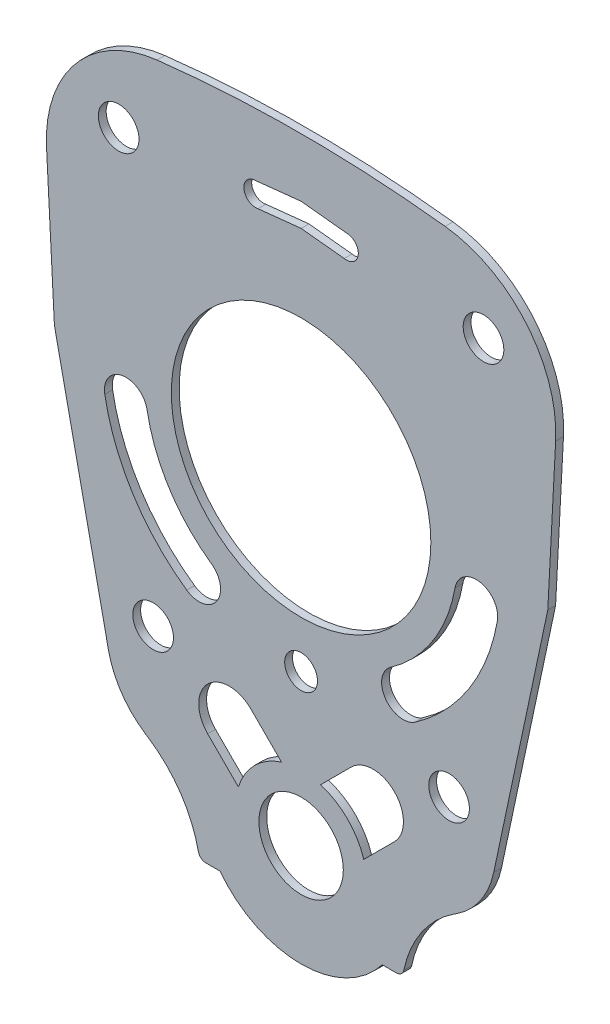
ISO-10303-21;
HEADER;
FILE_DESCRIPTION(('STEP AP214'),'2;1');
FILE_NAME('part.step','',(''),(''),'','','');
FILE_SCHEMA(('AUTOMOTIVE_DESIGN { 1 0 10303 214 1 1 1 1 }'));
ENDSEC;
DATA;
#1=APPLICATION_CONTEXT('core data for automotive mechanical design processes');
#2=APPLICATION_PROTOCOL_DEFINITION('international standard','automotive_design',2000,#1);
#3=PRODUCT_CONTEXT('',#1,'mechanical');
#4=PRODUCT('Part','Part','',(#3));
#5=PRODUCT_RELATED_PRODUCT_CATEGORY('part','',(#4));
#6=PRODUCT_DEFINITION_FORMATION('','',#4);
#7=PRODUCT_DEFINITION_CONTEXT('part definition',#1,'design');
#8=PRODUCT_DEFINITION('design','',#6,#7);
#9=PRODUCT_DEFINITION_SHAPE('','',#8);
#10=(LENGTH_UNIT() NAMED_UNIT(*) SI_UNIT(.MILLI.,.METRE.));
#11=(NAMED_UNIT(*) PLANE_ANGLE_UNIT() SI_UNIT($,.RADIAN.));
#12=(NAMED_UNIT(*) SI_UNIT($,.STERADIAN.) SOLID_ANGLE_UNIT());
#13=UNCERTAINTY_MEASURE_WITH_UNIT(LENGTH_MEASURE(1.E-05),#10,'distance_accuracy_value','');
#14=(GEOMETRIC_REPRESENTATION_CONTEXT(3) GLOBAL_UNCERTAINTY_ASSIGNED_CONTEXT((#13)) GLOBAL_UNIT_ASSIGNED_CONTEXT((#10,
#11,#12)) REPRESENTATION_CONTEXT('',''));
#15=CARTESIAN_POINT('',(0.,0.,0.));
#16=DIRECTION('',(0.,0.,1.));
#17=DIRECTION('',(1.,0.,0.));
#18=AXIS2_PLACEMENT_3D('',#15,#16,#17);
#19=CARTESIAN_POINT('',(-12.1673546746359,-48.89,1.));
#20=DIRECTION('',(0.,0.,-1.));
#21=DIRECTION('',(-1.,0.,0.));
#22=AXIS2_PLACEMENT_3D('',#19,#20,#21);
#23=CYLINDRICAL_SURFACE('',#22,1.);
#24=CARTESIAN_POINT('',(-12.1673546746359,-48.89,0.));
#25=DIRECTION('',(0.,0.,1.));
#26=DIRECTION('',(1.,0.,0.));
#27=AXIS2_PLACEMENT_3D('',#24,#25,#26);
#28=CIRCLE('',#27,1.);
#29=CARTESIAN_POINT('',(-13.1456816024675,-49.0970662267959,0.));
#30=VERTEX_POINT('',#29);
#31=CARTESIAN_POINT('',(-12.1673546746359,-49.89,0.));
#32=VERTEX_POINT('',#31);
#33=EDGE_CURVE('E757',#30,#32,#28,.T.);
#34=ORIENTED_EDGE('',*,*,#33,.T.);
#35=DIRECTION('',(0.,0.,-1.));
#36=VECTOR('',#35,1.);
#37=CARTESIAN_POINT('',(-12.1673546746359,-49.89,1.));
#38=LINE('',#37,#36);
#39=CARTESIAN_POINT('',(-12.1673546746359,-49.89,1.));
#40=VERTEX_POINT('',#39);
#41=EDGE_CURVE('E882',#40,#32,#38,.T.);
#42=ORIENTED_EDGE('',*,*,#41,.F.);
#43=CARTESIAN_POINT('',(-12.1673546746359,-48.89,1.));
#44=DIRECTION('',(0.,0.,1.));
#45=DIRECTION('',(1.,0.,0.));
#46=AXIS2_PLACEMENT_3D('',#43,#44,#45);
#47=CIRCLE('',#46,1.);
#48=CARTESIAN_POINT('',(-13.1456816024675,-49.0970662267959,1.));
#49=VERTEX_POINT('',#48);
#50=EDGE_CURVE('E794',#49,#40,#47,.T.);
#51=ORIENTED_EDGE('',*,*,#50,.F.);
#52=DIRECTION('',(0.,0.,-1.));
#53=VECTOR('',#52,1.);
#54=CARTESIAN_POINT('',(-13.1456816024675,-49.0970662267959,1.));
#55=LINE('',#54,#53);
#56=EDGE_CURVE('E831',#49,#30,#55,.T.);
#57=ORIENTED_EDGE('',*,*,#56,.T.);
#58=EDGE_LOOP('',(#34,#42,#51,#57));
#59=FACE_BOUND('',#58,.T.);
#60=ADVANCED_FACE('F358',(#59),#23,.T.);
#61=CARTESIAN_POINT('',(-12.1673546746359,-49.89,1.));
#62=DIRECTION('',(0.,1.,0.));
#63=DIRECTION('',(0.,0.,1.));
#64=AXIS2_PLACEMENT_3D('',#61,#62,#63);
#65=PLANE('',#64);
#66=DIRECTION('',(1.,0.,0.));
#67=VECTOR('',#66,1.);
#68=CARTESIAN_POINT('',(-12.1673546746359,-49.89,0.));
#69=LINE('',#68,#67);
#70=CARTESIAN_POINT('',(-10.3812282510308,-49.89,0.));
#71=VERTEX_POINT('',#70);
#72=EDGE_CURVE('E760',#32,#71,#69,.T.);
#73=ORIENTED_EDGE('',*,*,#72,.T.);
#74=DIRECTION('',(0.,0.,-1.));
#75=VECTOR('',#74,1.);
#76=CARTESIAN_POINT('',(-10.3812282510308,-49.89,1.));
#77=LINE('',#76,#75);
#78=CARTESIAN_POINT('',(-10.3812282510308,-49.89,1.));
#79=VERTEX_POINT('',#78);
#80=EDGE_CURVE('E879',#79,#71,#77,.T.);
#81=ORIENTED_EDGE('',*,*,#80,.F.);
#82=DIRECTION('',(1.,0.,0.));
#83=VECTOR('',#82,1.);
#84=CARTESIAN_POINT('',(-12.1673546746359,-49.89,1.));
#85=LINE('',#84,#83);
#86=EDGE_CURVE('E797',#40,#79,#85,.T.);
#87=ORIENTED_EDGE('',*,*,#86,.F.);
#88=ORIENTED_EDGE('',*,*,#41,.T.);
#89=EDGE_LOOP('',(#73,#81,#87,#88));
#90=FACE_BOUND('',#89,.T.);
#91=ADVANCED_FACE('F974',(#90),#65,.F.);
#92=CARTESIAN_POINT('',(0.,-41.9,1.));
#93=DIRECTION('',(0.,0.,-1.));
#94=DIRECTION('',(-1.,0.,0.));
#95=AXIS2_PLACEMENT_3D('',#92,#93,#94);
#96=CYLINDRICAL_SURFACE('',#95,13.1);
#97=CARTESIAN_POINT('',(0.,-41.9,0.));
#98=DIRECTION('',(0.,0.,1.));
#99=DIRECTION('',(1.,0.,0.));
#100=AXIS2_PLACEMENT_3D('',#97,#98,#99);
#101=CIRCLE('',#100,13.1);
#102=CARTESIAN_POINT('',(10.3812282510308,-49.89,0.));
#103=VERTEX_POINT('',#102);
#104=EDGE_CURVE('E762',#71,#103,#101,.T.);
#105=ORIENTED_EDGE('',*,*,#104,.T.);
#106=DIRECTION('',(0.,0.,-1.));
#107=VECTOR('',#106,1.);
#108=CARTESIAN_POINT('',(10.3812282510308,-49.89,1.));
#109=LINE('',#108,#107);
#110=CARTESIAN_POINT('',(10.3812282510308,-49.89,1.));
#111=VERTEX_POINT('',#110);
#112=EDGE_CURVE('E876',#111,#103,#109,.T.);
#113=ORIENTED_EDGE('',*,*,#112,.F.);
#114=CARTESIAN_POINT('',(0.,-41.9,1.));
#115=DIRECTION('',(0.,0.,1.));
#116=DIRECTION('',(1.,0.,0.));
#117=AXIS2_PLACEMENT_3D('',#114,#115,#116);
#118=CIRCLE('',#117,13.1);
#119=EDGE_CURVE('E799',#79,#111,#118,.T.);
#120=ORIENTED_EDGE('',*,*,#119,.F.);
#121=ORIENTED_EDGE('',*,*,#80,.T.);
#122=EDGE_LOOP('',(#105,#113,#120,#121));
#123=FACE_BOUND('',#122,.T.);
#124=ADVANCED_FACE('F979',(#123),#96,.T.);
#125=CARTESIAN_POINT('',(10.3812282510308,-49.89,1.));
#126=DIRECTION('',(0.,1.,0.));
#127=DIRECTION('',(0.,0.,1.));
#128=AXIS2_PLACEMENT_3D('',#125,#126,#127);
#129=PLANE('',#128);
#130=DIRECTION('',(1.,0.,0.));
#131=VECTOR('',#130,1.);
#132=CARTESIAN_POINT('',(10.3812282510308,-49.89,0.));
#133=LINE('',#132,#131);
#134=CARTESIAN_POINT('',(12.1673546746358,-49.89,0.));
#135=VERTEX_POINT('',#134);
#136=EDGE_CURVE('E764',#103,#135,#133,.T.);
#137=ORIENTED_EDGE('',*,*,#136,.T.);
#138=DIRECTION('',(0.,0.,-1.));
#139=VECTOR('',#138,1.);
#140=CARTESIAN_POINT('',(12.1673546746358,-49.89,1.));
#141=LINE('',#140,#139);
#142=CARTESIAN_POINT('',(12.1673546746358,-49.89,1.));
#143=VERTEX_POINT('',#142);
#144=EDGE_CURVE('E873',#143,#135,#141,.T.);
#145=ORIENTED_EDGE('',*,*,#144,.F.);
#146=DIRECTION('',(1.,0.,0.));
#147=VECTOR('',#146,1.);
#148=CARTESIAN_POINT('',(10.3812282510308,-49.89,1.));
#149=LINE('',#148,#147);
#150=EDGE_CURVE('E801',#111,#143,#149,.T.);
#151=ORIENTED_EDGE('',*,*,#150,.F.);
#152=ORIENTED_EDGE('',*,*,#112,.T.);
#153=EDGE_LOOP('',(#137,#145,#151,#152));
#154=FACE_BOUND('',#153,.T.);
#155=ADVANCED_FACE('F1062',(#154),#129,.F.);
#156=CARTESIAN_POINT('',(12.1673546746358,-48.89,1.));
#157=DIRECTION('',(0.,0.,-1.));
#158=DIRECTION('',(-1.,0.,0.));
#159=AXIS2_PLACEMENT_3D('',#156,#157,#158);
#160=CYLINDRICAL_SURFACE('',#159,1.);
#161=CARTESIAN_POINT('',(12.1673546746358,-48.89,0.));
#162=DIRECTION('',(0.,0.,1.));
#163=DIRECTION('',(1.,0.,0.));
#164=AXIS2_PLACEMENT_3D('',#161,#162,#163);
#165=CIRCLE('',#164,1.);
#166=CARTESIAN_POINT('',(13.1456816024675,-49.0970662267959,0.));
#167=VERTEX_POINT('',#166);
#168=EDGE_CURVE('E766',#135,#167,#165,.T.);
#169=ORIENTED_EDGE('',*,*,#168,.T.);
#170=DIRECTION('',(0.,0.,-1.));
#171=VECTOR('',#170,1.);
#172=CARTESIAN_POINT('',(13.1456816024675,-49.0970662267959,1.));
#173=LINE('',#172,#171);
#174=CARTESIAN_POINT('',(13.1456816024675,-49.0970662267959,1.));
#175=VERTEX_POINT('',#174);
#176=EDGE_CURVE('E870',#175,#167,#173,.T.);
#177=ORIENTED_EDGE('',*,*,#176,.F.);
#178=CARTESIAN_POINT('',(12.1673546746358,-48.89,1.));
#179=DIRECTION('',(0.,0.,1.));
#180=DIRECTION('',(1.,0.,0.));
#181=AXIS2_PLACEMENT_3D('',#178,#179,#180);
#182=CIRCLE('',#181,1.);
#183=EDGE_CURVE('E803',#143,#175,#182,.T.);
#184=ORIENTED_EDGE('',*,*,#183,.F.);
#185=ORIENTED_EDGE('',*,*,#144,.T.);
#186=EDGE_LOOP('',(#169,#177,#184,#185));
#187=FACE_BOUND('',#186,.T.);
#188=ADVANCED_FACE('F1059',(#187),#160,.T.);
#189=CARTESIAN_POINT('',(27.8205855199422,-52.2030596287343,1.));
#190=DIRECTION('',(0.,0.,-1.));
#191=DIRECTION('',(-1.,0.,0.));
#192=AXIS2_PLACEMENT_3D('',#189,#190,#191);
#193=CYLINDRICAL_SURFACE('',#192,14.9999999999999);
#194=CARTESIAN_POINT('',(27.8205855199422,-52.2030596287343,0.));
#195=DIRECTION('',(0.,0.,-1.));
#196=DIRECTION('',(1.,0.,0.));
#197=AXIS2_PLACEMENT_3D('',#194,#195,#196);
#198=CIRCLE('',#197,14.9999999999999);
#199=CARTESIAN_POINT('',(19.4999999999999,-39.7223602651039,0.));
#200=VERTEX_POINT('',#199);
#201=EDGE_CURVE('E768',#167,#200,#198,.T.);
#202=ORIENTED_EDGE('',*,*,#201,.T.);
#203=DIRECTION('',(0.,0.,-1.));
#204=VECTOR('',#203,1.);
#205=CARTESIAN_POINT('',(19.4999999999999,-39.7223602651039,1.));
#206=LINE('',#205,#204);
#207=CARTESIAN_POINT('',(19.4999999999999,-39.7223602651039,1.));
#208=VERTEX_POINT('',#207);
#209=EDGE_CURVE('E867',#208,#200,#206,.T.);
#210=ORIENTED_EDGE('',*,*,#209,.F.);
#211=CARTESIAN_POINT('',(27.8205855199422,-52.2030596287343,1.));
#212=DIRECTION('',(0.,0.,-1.));
#213=DIRECTION('',(1.,0.,0.));
#214=AXIS2_PLACEMENT_3D('',#211,#212,#213);
#215=CIRCLE('',#214,14.9999999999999);
#216=EDGE_CURVE('E805',#175,#208,#215,.T.);
#217=ORIENTED_EDGE('',*,*,#216,.F.);
#218=ORIENTED_EDGE('',*,*,#176,.T.);
#219=EDGE_LOOP('',(#202,#210,#217,#218));
#220=FACE_BOUND('',#219,.T.);
#221=ADVANCED_FACE('F1055',(#220),#193,.F.);
#222=CARTESIAN_POINT('',(19.4999999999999,-39.7223602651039,1.));
#223=DIRECTION('',(-0.54463903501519,0.838670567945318,0.));
#224=DIRECTION('',(-0.838670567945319,-0.54463903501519,0.));
#225=AXIS2_PLACEMENT_3D('',#222,#223,#224);
#226=PLANE('',#225);
#227=DIRECTION('',(0.838670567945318,0.54463903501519,0.));
#228=VECTOR('',#227,1.);
#229=CARTESIAN_POINT('',(19.4999999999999,-39.7223602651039,0.));
#230=LINE('',#229,#228);
#231=CARTESIAN_POINT('',(19.8707912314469,-39.4815656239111,0.));
#232=VERTEX_POINT('',#231);
#233=EDGE_CURVE('E770',#200,#232,#230,.T.);
#234=ORIENTED_EDGE('',*,*,#233,.T.);
#235=DIRECTION('',(0.,0.,-1.));
#236=VECTOR('',#235,1.);
#237=CARTESIAN_POINT('',(19.8707912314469,-39.4815656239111,1.));
#238=LINE('',#237,#236);
#239=CARTESIAN_POINT('',(19.8707912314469,-39.4815656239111,1.));
#240=VERTEX_POINT('',#239);
#241=EDGE_CURVE('E864',#240,#232,#238,.T.);
#242=ORIENTED_EDGE('',*,*,#241,.F.);
#243=DIRECTION('',(0.838670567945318,0.54463903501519,0.));
#244=VECTOR('',#243,1.);
#245=CARTESIAN_POINT('',(19.4999999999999,-39.7223602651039,1.));
#246=LINE('',#245,#244);
#247=EDGE_CURVE('E807',#208,#240,#246,.T.);
#248=ORIENTED_EDGE('',*,*,#247,.F.);
#249=ORIENTED_EDGE('',*,*,#209,.T.);
#250=EDGE_LOOP('',(#234,#242,#248,#249));
#251=FACE_BOUND('',#250,.T.);
#252=ADVANCED_FACE('F1050',(#251),#226,.F.);
#253=CARTESIAN_POINT('',(13.8797618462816,-30.2561893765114,1.));
#254=DIRECTION('',(0.,0.,-1.));
#255=DIRECTION('',(-1.,0.,0.));
#256=AXIS2_PLACEMENT_3D('',#253,#254,#255);
#257=CYLINDRICAL_SURFACE('',#256,11.);
#258=CARTESIAN_POINT('',(13.8797618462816,-30.2561893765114,0.));
#259=DIRECTION('',(0.,0.,1.));
#260=DIRECTION('',(1.,0.,0.));
#261=AXIS2_PLACEMENT_3D('',#258,#259,#260);
#262=CIRCLE('',#261,11.);
#263=CARTESIAN_POINT('',(24.6393854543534,-32.5432179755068,0.));
#264=VERTEX_POINT('',#263);
#265=EDGE_CURVE('E772',#232,#264,#262,.T.);
#266=ORIENTED_EDGE('',*,*,#265,.T.);
#267=DIRECTION('',(0.,0.,-1.));
#268=VECTOR('',#267,1.);
#269=CARTESIAN_POINT('',(24.6393854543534,-32.5432179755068,1.));
#270=LINE('',#269,#268);
#271=CARTESIAN_POINT('',(24.6393854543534,-32.5432179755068,1.));
#272=VERTEX_POINT('',#271);
#273=EDGE_CURVE('E861',#272,#264,#270,.T.);
#274=ORIENTED_EDGE('',*,*,#273,.F.);
#275=CARTESIAN_POINT('',(13.8797618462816,-30.2561893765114,1.));
#276=DIRECTION('',(0.,0.,1.));
#277=DIRECTION('',(1.,0.,0.));
#278=AXIS2_PLACEMENT_3D('',#275,#276,#277);
#279=CIRCLE('',#278,11.);
#280=EDGE_CURVE('E809',#240,#272,#279,.T.);
#281=ORIENTED_EDGE('',*,*,#280,.F.);
#282=ORIENTED_EDGE('',*,*,#241,.T.);
#283=EDGE_LOOP('',(#266,#274,#281,#282));
#284=FACE_BOUND('',#283,.T.);
#285=ADVANCED_FACE('F1044',(#284),#257,.T.);
#286=CARTESIAN_POINT('',(24.6393854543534,-32.5432179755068,1.));
#287=DIRECTION('',(-0.978147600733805,0.207911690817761,0.));
#288=DIRECTION('',(-0.207911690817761,-0.978147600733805,0.));
#289=AXIS2_PLACEMENT_3D('',#286,#287,#288);
#290=PLANE('',#289);
#291=DIRECTION('',(0.207911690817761,0.978147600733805,0.));
#292=VECTOR('',#291,1.);
#293=CARTESIAN_POINT('',(24.6393854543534,-32.5432179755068,0.));
#294=LINE('',#293,#292);
#295=CARTESIAN_POINT('',(31.5566599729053,0.,0.));
#296=VERTEX_POINT('',#295);
#297=EDGE_CURVE('E774',#264,#296,#294,.T.);
#298=ORIENTED_EDGE('',*,*,#297,.T.);
#299=DIRECTION('',(0.,0.,-1.));
#300=VECTOR('',#299,1.);
#301=CARTESIAN_POINT('',(31.5566599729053,0.,1.));
#302=LINE('',#301,#300);
#303=CARTESIAN_POINT('',(31.5566599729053,0.,1.));
#304=VERTEX_POINT('',#303);
#305=EDGE_CURVE('E858',#304,#296,#302,.T.);
#306=ORIENTED_EDGE('',*,*,#305,.F.);
#307=DIRECTION('',(0.207911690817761,0.978147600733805,0.));
#308=VECTOR('',#307,1.);
#309=CARTESIAN_POINT('',(24.6393854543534,-32.5432179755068,1.));
#310=LINE('',#309,#308);
#311=EDGE_CURVE('E811',#272,#304,#310,.T.);
#312=ORIENTED_EDGE('',*,*,#311,.F.);
#313=ORIENTED_EDGE('',*,*,#273,.T.);
#314=EDGE_LOOP('',(#298,#306,#312,#313));
#315=FACE_BOUND('',#314,.T.);
#316=ADVANCED_FACE('F1040',(#315),#290,.F.);
#317=CARTESIAN_POINT('',(31.5566599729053,0.,1.));
#318=DIRECTION('',(-0.998629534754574,0.0523359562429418,0.));
#319=DIRECTION('',(-0.0523359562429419,-0.998629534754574,0.));
#320=AXIS2_PLACEMENT_3D('',#317,#318,#319);
#321=PLANE('',#320);
#322=DIRECTION('',(0.0523359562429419,0.998629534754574,0.));
#323=VECTOR('',#322,1.);
#324=CARTESIAN_POINT('',(31.5566599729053,0.,0.));
#325=LINE('',#324,#323);
#326=CARTESIAN_POINT('',(32.5631175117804,19.204353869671,0.));
#327=VERTEX_POINT('',#326);
#328=EDGE_CURVE('E776',#296,#327,#325,.T.);
#329=ORIENTED_EDGE('',*,*,#328,.T.);
#330=DIRECTION('',(0.,0.,-1.));
#331=VECTOR('',#330,1.);
#332=CARTESIAN_POINT('',(32.5631175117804,19.204353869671,1.));
#333=LINE('',#332,#331);
#334=CARTESIAN_POINT('',(32.5631175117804,19.204353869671,1.));
#335=VERTEX_POINT('',#334);
#336=EDGE_CURVE('E855',#335,#327,#333,.T.);
#337=ORIENTED_EDGE('',*,*,#336,.F.);
#338=DIRECTION('',(0.0523359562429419,0.998629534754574,0.));
#339=VECTOR('',#338,1.);
#340=CARTESIAN_POINT('',(31.5566599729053,0.,1.));
#341=LINE('',#340,#339);
#342=EDGE_CURVE('E813',#304,#335,#341,.T.);
#343=ORIENTED_EDGE('',*,*,#342,.F.);
#344=ORIENTED_EDGE('',*,*,#305,.T.);
#345=EDGE_LOOP('',(#329,#337,#343,#344));
#346=FACE_BOUND('',#345,.T.);
#347=ADVANCED_FACE('F1035',(#346),#321,.F.);
#348=CARTESIAN_POINT('',(16.5850449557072,20.0417291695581,1.));
#349=DIRECTION('',(0.,0.,-1.));
#350=DIRECTION('',(-1.,0.,0.));
#351=AXIS2_PLACEMENT_3D('',#348,#349,#350);
#352=CYLINDRICAL_SURFACE('',#351,16.);
#353=CARTESIAN_POINT('',(16.5850449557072,20.0417291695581,0.));
#354=DIRECTION('',(0.,0.,1.));
#355=DIRECTION('',(1.,0.,0.));
#356=AXIS2_PLACEMENT_3D('',#353,#354,#355);
#357=CIRCLE('',#356,16.);
#358=CARTESIAN_POINT('',(18.4278277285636,35.9352546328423,0.));
#359=VERTEX_POINT('',#358);
#360=EDGE_CURVE('E778',#327,#359,#357,.T.);
#361=ORIENTED_EDGE('',*,*,#360,.T.);
#362=DIRECTION('',(0.,0.,-1.));
#363=VECTOR('',#362,1.);
#364=CARTESIAN_POINT('',(18.4278277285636,35.9352546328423,1.));
#365=LINE('',#364,#363);
#366=CARTESIAN_POINT('',(18.4278277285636,35.9352546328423,1.));
#367=VERTEX_POINT('',#366);
#368=EDGE_CURVE('E852',#367,#359,#365,.T.);
#369=ORIENTED_EDGE('',*,*,#368,.F.);
#370=CARTESIAN_POINT('',(16.5850449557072,20.0417291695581,1.));
#371=DIRECTION('',(0.,0.,1.));
#372=DIRECTION('',(1.,0.,0.));
#373=AXIS2_PLACEMENT_3D('',#370,#371,#372);
#374=CIRCLE('',#373,16.);
#375=EDGE_CURVE('E815',#335,#367,#374,.T.);
#376=ORIENTED_EDGE('',*,*,#375,.F.);
#377=ORIENTED_EDGE('',*,*,#336,.T.);
#378=EDGE_LOOP('',(#361,#369,#376,#377));
#379=FACE_BOUND('',#378,.T.);
#380=ADVANCED_FACE('F1029',(#379),#352,.T.);
#381=CARTESIAN_POINT('',(0.,-123.,1.));
#382=DIRECTION('',(0.,0.,-1.));
#383=DIRECTION('',(-1.,0.,0.));
#384=AXIS2_PLACEMENT_3D('',#381,#382,#383);
#385=CYLINDRICAL_SURFACE('',#384,160.);
#386=CARTESIAN_POINT('',(0.,-123.,0.));
#387=DIRECTION('',(0.,0.,1.));
#388=DIRECTION('',(1.,0.,0.));
#389=AXIS2_PLACEMENT_3D('',#386,#387,#388);
#390=CIRCLE('',#389,160.);
#391=CARTESIAN_POINT('',(-18.4278277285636,35.9352546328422,0.));
#392=VERTEX_POINT('',#391);
#393=EDGE_CURVE('E780',#359,#392,#390,.T.);
#394=ORIENTED_EDGE('',*,*,#393,.T.);
#395=DIRECTION('',(0.,0.,-1.));
#396=VECTOR('',#395,1.);
#397=CARTESIAN_POINT('',(-18.4278277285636,35.9352546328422,1.));
#398=LINE('',#397,#396);
#399=CARTESIAN_POINT('',(-18.4278277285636,35.9352546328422,1.));
#400=VERTEX_POINT('',#399);
#401=EDGE_CURVE('E849',#400,#392,#398,.T.);
#402=ORIENTED_EDGE('',*,*,#401,.F.);
#403=CARTESIAN_POINT('',(0.,-123.,1.));
#404=DIRECTION('',(0.,0.,1.));
#405=DIRECTION('',(1.,0.,0.));
#406=AXIS2_PLACEMENT_3D('',#403,#404,#405);
#407=CIRCLE('',#406,160.);
#408=EDGE_CURVE('E817',#367,#400,#407,.T.);
#409=ORIENTED_EDGE('',*,*,#408,.F.);
#410=ORIENTED_EDGE('',*,*,#368,.T.);
#411=EDGE_LOOP('',(#394,#402,#409,#410));
#412=FACE_BOUND('',#411,.T.);
#413=ADVANCED_FACE('F1025',(#412),#385,.T.);
#414=CARTESIAN_POINT('',(-16.5850449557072,20.041729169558,1.));
#415=DIRECTION('',(0.,0.,-1.));
#416=DIRECTION('',(-1.,0.,0.));
#417=AXIS2_PLACEMENT_3D('',#414,#415,#416);
#418=CYLINDRICAL_SURFACE('',#417,16.);
#419=CARTESIAN_POINT('',(-16.5850449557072,20.041729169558,0.));
#420=DIRECTION('',(0.,0.,1.));
#421=DIRECTION('',(1.,0.,0.));
#422=AXIS2_PLACEMENT_3D('',#419,#420,#421);
#423=CIRCLE('',#422,16.);
#424=CARTESIAN_POINT('',(-32.5631175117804,19.2043538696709,0.));
#425=VERTEX_POINT('',#424);
#426=EDGE_CURVE('E782',#392,#425,#423,.T.);
#427=ORIENTED_EDGE('',*,*,#426,.T.);
#428=DIRECTION('',(0.,0.,-1.));
#429=VECTOR('',#428,1.);
#430=CARTESIAN_POINT('',(-32.5631175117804,19.2043538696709,1.));
#431=LINE('',#430,#429);
#432=CARTESIAN_POINT('',(-32.5631175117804,19.2043538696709,1.));
#433=VERTEX_POINT('',#432);
#434=EDGE_CURVE('E846',#433,#425,#431,.T.);
#435=ORIENTED_EDGE('',*,*,#434,.F.);
#436=CARTESIAN_POINT('',(-16.5850449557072,20.041729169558,1.));
#437=DIRECTION('',(0.,0.,1.));
#438=DIRECTION('',(1.,0.,0.));
#439=AXIS2_PLACEMENT_3D('',#436,#437,#438);
#440=CIRCLE('',#439,16.);
#441=EDGE_CURVE('E819',#400,#433,#440,.T.);
#442=ORIENTED_EDGE('',*,*,#441,.F.);
#443=ORIENTED_EDGE('',*,*,#401,.T.);
#444=EDGE_LOOP('',(#427,#435,#442,#443));
#445=FACE_BOUND('',#444,.T.);
#446=ADVANCED_FACE('F1020',(#445),#418,.T.);
#447=CARTESIAN_POINT('',(-32.5631175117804,19.2043538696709,1.));
#448=DIRECTION('',(0.998629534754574,0.0523359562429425,0.));
#449=DIRECTION('',(-0.0523359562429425,0.998629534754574,0.));
#450=AXIS2_PLACEMENT_3D('',#447,#448,#449);
#451=PLANE('',#450);
#452=DIRECTION('',(0.0523359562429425,-0.998629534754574,0.));
#453=VECTOR('',#452,1.);
#454=CARTESIAN_POINT('',(-32.5631175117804,19.2043538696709,0.));
#455=LINE('',#454,#453);
#456=CARTESIAN_POINT('',(-31.5566599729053,0.,0.));
#457=VERTEX_POINT('',#456);
#458=EDGE_CURVE('E784',#425,#457,#455,.T.);
#459=ORIENTED_EDGE('',*,*,#458,.T.);
#460=DIRECTION('',(0.,0.,-1.));
#461=VECTOR('',#460,1.);
#462=CARTESIAN_POINT('',(-31.5566599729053,0.,1.));
#463=LINE('',#462,#461);
#464=CARTESIAN_POINT('',(-31.5566599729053,0.,1.));
#465=VERTEX_POINT('',#464);
#466=EDGE_CURVE('E843',#465,#457,#463,.T.);
#467=ORIENTED_EDGE('',*,*,#466,.F.);
#468=DIRECTION('',(0.0523359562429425,-0.998629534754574,0.));
#469=VECTOR('',#468,1.);
#470=CARTESIAN_POINT('',(-32.5631175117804,19.2043538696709,1.));
#471=LINE('',#470,#469);
#472=EDGE_CURVE('E821',#433,#465,#471,.T.);
#473=ORIENTED_EDGE('',*,*,#472,.F.);
#474=ORIENTED_EDGE('',*,*,#434,.T.);
#475=EDGE_LOOP('',(#459,#467,#473,#474));
#476=FACE_BOUND('',#475,.T.);
#477=ADVANCED_FACE('F1014',(#476),#451,.F.);
#478=CARTESIAN_POINT('',(-31.5566599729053,0.,1.));
#479=DIRECTION('',(0.978147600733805,0.20791169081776,0.));
#480=DIRECTION('',(-0.20791169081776,0.978147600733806,0.));
#481=AXIS2_PLACEMENT_3D('',#478,#479,#480);
#482=PLANE('',#481);
#483=DIRECTION('',(0.20791169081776,-0.978147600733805,0.));
#484=VECTOR('',#483,1.);
#485=CARTESIAN_POINT('',(-31.5566599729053,0.,0.));
#486=LINE('',#485,#484);
#487=CARTESIAN_POINT('',(-24.6393854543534,-32.5432179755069,0.));
#488=VERTEX_POINT('',#487);
#489=EDGE_CURVE('E786',#457,#488,#486,.T.);
#490=ORIENTED_EDGE('',*,*,#489,.T.);
#491=DIRECTION('',(0.,0.,-1.));
#492=VECTOR('',#491,1.);
#493=CARTESIAN_POINT('',(-24.6393854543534,-32.5432179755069,1.));
#494=LINE('',#493,#492);
#495=CARTESIAN_POINT('',(-24.6393854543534,-32.5432179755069,1.));
#496=VERTEX_POINT('',#495);
#497=EDGE_CURVE('E840',#496,#488,#494,.T.);
#498=ORIENTED_EDGE('',*,*,#497,.F.);
#499=DIRECTION('',(0.20791169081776,-0.978147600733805,0.));
#500=VECTOR('',#499,1.);
#501=CARTESIAN_POINT('',(-31.5566599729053,0.,1.));
#502=LINE('',#501,#500);
#503=EDGE_CURVE('E823',#465,#496,#502,.T.);
#504=ORIENTED_EDGE('',*,*,#503,.F.);
#505=ORIENTED_EDGE('',*,*,#466,.T.);
#506=EDGE_LOOP('',(#490,#498,#504,#505));
#507=FACE_BOUND('',#506,.T.);
#508=ADVANCED_FACE('F1010',(#507),#482,.F.);
#509=CARTESIAN_POINT('',(-13.8797618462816,-30.2561893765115,1.));
#510=DIRECTION('',(0.,0.,-1.));
#511=DIRECTION('',(-1.,0.,0.));
#512=AXIS2_PLACEMENT_3D('',#509,#510,#511);
#513=CYLINDRICAL_SURFACE('',#512,11.);
#514=CARTESIAN_POINT('',(-13.8797618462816,-30.2561893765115,0.));
#515=DIRECTION('',(0.,0.,1.));
#516=DIRECTION('',(1.,0.,0.));
#517=AXIS2_PLACEMENT_3D('',#514,#515,#516);
#518=CIRCLE('',#517,11.);
#519=CARTESIAN_POINT('',(-19.8707912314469,-39.4815656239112,0.));
#520=VERTEX_POINT('',#519);
#521=EDGE_CURVE('E788',#488,#520,#518,.T.);
#522=ORIENTED_EDGE('',*,*,#521,.T.);
#523=DIRECTION('',(0.,0.,-1.));
#524=VECTOR('',#523,1.);
#525=CARTESIAN_POINT('',(-19.8707912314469,-39.4815656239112,1.));
#526=LINE('',#525,#524);
#527=CARTESIAN_POINT('',(-19.8707912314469,-39.4815656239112,1.));
#528=VERTEX_POINT('',#527);
#529=EDGE_CURVE('E837',#528,#520,#526,.T.);
#530=ORIENTED_EDGE('',*,*,#529,.F.);
#531=CARTESIAN_POINT('',(-13.8797618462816,-30.2561893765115,1.));
#532=DIRECTION('',(0.,0.,1.));
#533=DIRECTION('',(1.,0.,0.));
#534=AXIS2_PLACEMENT_3D('',#531,#532,#533);
#535=CIRCLE('',#534,11.);
#536=EDGE_CURVE('E825',#496,#528,#535,.T.);
#537=ORIENTED_EDGE('',*,*,#536,.F.);
#538=ORIENTED_EDGE('',*,*,#497,.T.);
#539=EDGE_LOOP('',(#522,#530,#537,#538));
#540=FACE_BOUND('',#539,.T.);
#541=ADVANCED_FACE('F1005',(#540),#513,.T.);
#542=CARTESIAN_POINT('',(-19.8707912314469,-39.4815656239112,1.));
#543=DIRECTION('',(0.544639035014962,0.838670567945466,0.));
#544=DIRECTION('',(-0.838670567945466,0.544639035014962,0.));
#545=AXIS2_PLACEMENT_3D('',#542,#543,#544);
#546=PLANE('',#545);
#547=DIRECTION('',(0.838670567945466,-0.544639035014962,0.));
#548=VECTOR('',#547,1.);
#549=CARTESIAN_POINT('',(-19.8707912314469,-39.4815656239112,0.));
#550=LINE('',#549,#548);
#551=CARTESIAN_POINT('',(-19.4999999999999,-39.7223602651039,0.));
#552=VERTEX_POINT('',#551);
#553=EDGE_CURVE('E790',#520,#552,#550,.T.);
#554=ORIENTED_EDGE('',*,*,#553,.T.);
#555=DIRECTION('',(0.,0.,-1.));
#556=VECTOR('',#555,1.);
#557=CARTESIAN_POINT('',(-19.4999999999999,-39.7223602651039,1.));
#558=LINE('',#557,#556);
#559=CARTESIAN_POINT('',(-19.4999999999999,-39.7223602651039,1.));
#560=VERTEX_POINT('',#559);
#561=EDGE_CURVE('E834',#560,#552,#558,.T.);
#562=ORIENTED_EDGE('',*,*,#561,.F.);
#563=DIRECTION('',(0.838670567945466,-0.544639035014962,0.));
#564=VECTOR('',#563,1.);
#565=CARTESIAN_POINT('',(-19.8707912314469,-39.4815656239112,1.));
#566=LINE('',#565,#564);
#567=EDGE_CURVE('E827',#528,#560,#566,.T.);
#568=ORIENTED_EDGE('',*,*,#567,.F.);
#569=ORIENTED_EDGE('',*,*,#529,.T.);
#570=EDGE_LOOP('',(#554,#562,#568,#569));
#571=FACE_BOUND('',#570,.T.);
#572=ADVANCED_FACE('F999',(#571),#546,.F.);
#573=CARTESIAN_POINT('',(-27.8205855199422,-52.2030596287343,1.));
#574=DIRECTION('',(0.,0.,-1.));
#575=DIRECTION('',(-1.,0.,0.));
#576=AXIS2_PLACEMENT_3D('',#573,#574,#575);
#577=CYLINDRICAL_SURFACE('',#576,15.);
#578=CARTESIAN_POINT('',(-27.8205855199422,-52.2030596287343,0.));
#579=DIRECTION('',(0.,0.,-1.));
#580=DIRECTION('',(1.,0.,0.));
#581=AXIS2_PLACEMENT_3D('',#578,#579,#580);
#582=CIRCLE('',#581,15.);
#583=EDGE_CURVE('E792',#552,#30,#582,.T.);
#584=ORIENTED_EDGE('',*,*,#583,.T.);
#585=ORIENTED_EDGE('',*,*,#56,.F.);
#586=CARTESIAN_POINT('',(-27.8205855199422,-52.2030596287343,1.));
#587=DIRECTION('',(0.,0.,-1.));
#588=DIRECTION('',(1.,0.,0.));
#589=AXIS2_PLACEMENT_3D('',#586,#587,#588);
#590=CIRCLE('',#589,15.);
#591=EDGE_CURVE('E829',#560,#49,#590,.T.);
#592=ORIENTED_EDGE('',*,*,#591,.F.);
#593=ORIENTED_EDGE('',*,*,#561,.T.);
#594=EDGE_LOOP('',(#584,#585,#592,#593));
#595=FACE_BOUND('',#594,.T.);
#596=ADVANCED_FACE('F997',(#595),#577,.F.);
#597=CARTESIAN_POINT('',(-12.1673546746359,-48.89,1.));
#598=DIRECTION('',(0.,0.,1.));
#599=DIRECTION('',(1.,0.,0.));
#600=AXIS2_PLACEMENT_3D('',#597,#598,#599);
#601=PLANE('',#600);
#602=CARTESIAN_POINT('',(0.,-41.9,1.));
#603=DIRECTION('',(0.,0.,-1.));
#604=DIRECTION('',(1.,0.,0.));
#605=AXIS2_PLACEMENT_3D('',#602,#603,#604);
#606=CIRCLE('',#605,8.40000000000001);
#607=CARTESIAN_POINT('',(-8.01841982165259,-39.3970130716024,1.));
#608=VERTEX_POINT('',#607);
#609=CARTESIAN_POINT('',(-2.50298692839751,-33.8815801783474,1.));
#610=VERTEX_POINT('',#609);
#611=EDGE_CURVE('E372',#608,#610,#606,.T.);
#612=ORIENTED_EDGE('',*,*,#611,.F.);
#613=DIRECTION('',(0.707106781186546,-0.707106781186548,0.));
#614=VECTOR('',#613,1.);
#615=CARTESIAN_POINT('',(-11.9501046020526,-35.4653282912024,1.));
#616=LINE('',#615,#614);
#617=CARTESIAN_POINT('',(-11.9501046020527,-35.4653282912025,1.));
#618=VERTEX_POINT('',#617);
#619=EDGE_CURVE('E622',#618,#608,#616,.T.);
#620=ORIENTED_EDGE('',*,*,#619,.F.);
#621=CARTESIAN_POINT('',(-9.1923881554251,-32.7076118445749,1.));
#622=DIRECTION('',(0.,0.,1.));
#623=DIRECTION('',(1.,0.,0.));
#624=AXIS2_PLACEMENT_3D('',#621,#622,#623);
#625=CIRCLE('',#624,3.90000000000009);
#626=CARTESIAN_POINT('',(-6.43467170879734,-29.9498953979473,1.));
#627=VERTEX_POINT('',#626);
#628=EDGE_CURVE('E629',#627,#618,#625,.T.);
#629=ORIENTED_EDGE('',*,*,#628,.F.);
#630=DIRECTION('',(-0.707106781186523,0.707106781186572,0.));
#631=VECTOR('',#630,1.);
#632=CARTESIAN_POINT('',(-6.43467170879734,-29.9498953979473,1.));
#633=LINE('',#632,#631);
#634=EDGE_CURVE('E634',#610,#627,#633,.T.);
#635=ORIENTED_EDGE('',*,*,#634,.F.);
#636=EDGE_LOOP('',(#612,#620,#629,#635));
#637=FACE_BOUND('',#636,.T.);
#638=CARTESIAN_POINT('',(-18.9280223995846,-27.0320174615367,1.));
#639=DIRECTION('',(0.,0.,1.));
#640=DIRECTION('',(1.,0.,0.));
#641=AXIS2_PLACEMENT_3D('',#638,#639,#640);
#642=CIRCLE('',#641,2.6);
#643=CARTESIAN_POINT('',(-16.3280223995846,-27.0320174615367,1.));
#644=VERTEX_POINT('',#643);
#645=EDGE_CURVE('E628',#644,#644,#642,.T.);
#646=ORIENTED_EDGE('',*,*,#645,.F.);
#647=EDGE_LOOP('',(#646));
#648=FACE_BOUND('',#647,.T.);
#649=CARTESIAN_POINT('',(5.82152734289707,27.3881328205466,1.));
#650=DIRECTION('',(0.,0.,1.));
#651=DIRECTION('',(-1.,0.,0.));
#652=AXIS2_PLACEMENT_3D('',#649,#650,#651);
#653=CIRCLE('',#652,1.5);
#654=CARTESIAN_POINT('',(5.50965980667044,25.9209114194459,1.));
#655=VERTEX_POINT('',#654);
#656=CARTESIAN_POINT('',(5.82152734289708,28.8881328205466,1.));
#657=VERTEX_POINT('',#656);
#658=EDGE_CURVE('E643',#655,#657,#653,.T.);
#659=ORIENTED_EDGE('',*,*,#658,.F.);
#660=DIRECTION('',(0.994521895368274,-0.10452846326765,0.));
#661=VECTOR('',#660,1.);
#662=CARTESIAN_POINT('',(5.50965980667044,25.9209114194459,1.));
#663=LINE('',#662,#661);
#664=CARTESIAN_POINT('',(0.,26.5,1.));
#665=VERTEX_POINT('',#664);
#666=EDGE_CURVE('E657',#665,#655,#663,.T.);
#667=ORIENTED_EDGE('',*,*,#666,.F.);
#668=DIRECTION('',(0.994521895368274,0.10452846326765,0.));
#669=VECTOR('',#668,1.);
#670=CARTESIAN_POINT('',(-5.50965980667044,25.9209114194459,1.));
#671=LINE('',#670,#669);
#672=CARTESIAN_POINT('',(-5.50965980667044,25.9209114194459,1.));
#673=VERTEX_POINT('',#672);
#674=EDGE_CURVE('E654',#673,#665,#671,.T.);
#675=ORIENTED_EDGE('',*,*,#674,.F.);
#676=CARTESIAN_POINT('',(-5.82152734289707,27.3881328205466,1.));
#677=DIRECTION('',(0.,0.,1.));
#678=DIRECTION('',(1.,0.,0.));
#679=AXIS2_PLACEMENT_3D('',#676,#677,#678);
#680=CIRCLE('',#679,1.5);
#681=CARTESIAN_POINT('',(-5.82152734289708,28.8881328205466,1.));
#682=VERTEX_POINT('',#681);
#683=EDGE_CURVE('E651',#682,#673,#680,.T.);
#684=ORIENTED_EDGE('',*,*,#683,.F.);
#685=DIRECTION('',(-0.994521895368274,-0.10452846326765,0.));
#686=VECTOR('',#685,1.);
#687=CARTESIAN_POINT('',(0.,29.5,1.));
#688=LINE('',#687,#686);
#689=CARTESIAN_POINT('',(0.,29.5,1.));
#690=VERTEX_POINT('',#689);
#691=EDGE_CURVE('E648',#690,#682,#688,.T.);
#692=ORIENTED_EDGE('',*,*,#691,.F.);
#693=DIRECTION('',(-0.994521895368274,0.10452846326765,0.));
#694=VECTOR('',#693,1.);
#695=CARTESIAN_POINT('',(0.,29.5,1.));
#696=LINE('',#695,#694);
#697=EDGE_CURVE('E645',#657,#690,#696,.T.);
#698=ORIENTED_EDGE('',*,*,#697,.F.);
#699=EDGE_LOOP('',(#659,#667,#675,#684,#692,#698));
#700=FACE_BOUND('',#699,.T.);
#701=CARTESIAN_POINT('',(0.,0.,1.));
#702=DIRECTION('',(0.,0.,1.));
#703=DIRECTION('',(1.,0.,0.));
#704=AXIS2_PLACEMENT_3D('',#701,#702,#703);
#705=CIRCLE('',#704,25.5);
#706=CARTESIAN_POINT('',(-25.1125977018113,-4.42802853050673,1.));
#707=VERTEX_POINT('',#706);
#708=CARTESIAN_POINT('',(-14.6261991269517,-20.8883771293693,1.));
#709=VERTEX_POINT('',#708);
#710=EDGE_CURVE('E679',#707,#709,#705,.T.);
#711=ORIENTED_EDGE('',*,*,#710,.F.);
#712=CARTESIAN_POINT('',(-22.4043763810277,-3.95049604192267,1.));
#713=DIRECTION('',(0.,0.,1.));
#714=DIRECTION('',(1.,0.,0.));
#715=AXIS2_PLACEMENT_3D('',#712,#713,#714);
#716=CIRCLE('',#715,2.75);
#717=CARTESIAN_POINT('',(-19.6961550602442,-3.47296355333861,1.));
#718=VERTEX_POINT('',#717);
#719=EDGE_CURVE('E683',#718,#707,#716,.T.);
#720=ORIENTED_EDGE('',*,*,#719,.F.);
#721=CARTESIAN_POINT('',(0.,0.,1.));
#722=DIRECTION('',(0.,0.,-1.));
#723=DIRECTION('',(1.,0.,0.));
#724=AXIS2_PLACEMENT_3D('',#721,#722,#723);
#725=CIRCLE('',#724,20.);
#726=CARTESIAN_POINT('',(-11.4715287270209,-16.3830408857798,1.));
#727=VERTEX_POINT('',#726);
#728=EDGE_CURVE('E687',#727,#718,#725,.T.);
#729=ORIENTED_EDGE('',*,*,#728,.F.);
#730=CARTESIAN_POINT('',(-13.0488639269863,-18.6357090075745,1.));
#731=DIRECTION('',(0.,0.,1.));
#732=DIRECTION('',(1.,0.,0.));
#733=AXIS2_PLACEMENT_3D('',#730,#731,#732);
#734=CIRCLE('',#733,2.75);
#735=EDGE_CURVE('E690',#709,#727,#734,.T.);
#736=ORIENTED_EDGE('',*,*,#735,.F.);
#737=EDGE_LOOP('',(#711,#720,#729,#736));
#738=FACE_BOUND('',#737,.T.);
#739=CARTESIAN_POINT('',(0.,0.,1.));
#740=DIRECTION('',(0.,0.,1.));
#741=DIRECTION('',(1.,0.,0.));
#742=AXIS2_PLACEMENT_3D('',#739,#740,#741);
#743=CIRCLE('',#742,16.6);
#744=CARTESIAN_POINT('',(16.6,0.,1.));
#745=VERTEX_POINT('',#744);
#746=EDGE_CURVE('E686',#745,#745,#743,.T.);
#747=ORIENTED_EDGE('',*,*,#746,.F.);
#748=EDGE_LOOP('',(#747));
#749=FACE_BOUND('',#748,.T.);
#750=CARTESIAN_POINT('',(0.,-22.6,1.));
#751=DIRECTION('',(0.,0.,1.));
#752=DIRECTION('',(1.,0.,0.));
#753=AXIS2_PLACEMENT_3D('',#750,#751,#752);
#754=CIRCLE('',#753,2.1);
#755=CARTESIAN_POINT('',(2.1,-22.6,1.));
#756=VERTEX_POINT('',#755);
#757=EDGE_CURVE('E697',#756,#756,#754,.T.);
#758=ORIENTED_EDGE('',*,*,#757,.F.);
#759=EDGE_LOOP('',(#758));
#760=FACE_BOUND('',#759,.T.);
#761=CARTESIAN_POINT('',(18.9280223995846,-27.0320174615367,1.));
#762=DIRECTION('',(0.,0.,1.));
#763=DIRECTION('',(-1.,0.,0.));
#764=AXIS2_PLACEMENT_3D('',#761,#762,#763);
#765=CIRCLE('',#764,2.6);
#766=CARTESIAN_POINT('',(16.3280223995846,-27.0320174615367,1.));
#767=VERTEX_POINT('',#766);
#768=EDGE_CURVE('E701',#767,#767,#765,.T.);
#769=ORIENTED_EDGE('',*,*,#768,.F.);
#770=EDGE_LOOP('',(#769));
#771=FACE_BOUND('',#770,.T.);
#772=CARTESIAN_POINT('',(0.,-41.9,1.));
#773=DIRECTION('',(0.,0.,1.));
#774=DIRECTION('',(1.,0.,0.));
#775=AXIS2_PLACEMENT_3D('',#772,#773,#774);
#776=CIRCLE('',#775,5.4);
#777=CARTESIAN_POINT('',(5.4,-41.9,1.));
#778=VERTEX_POINT('',#777);
#779=EDGE_CURVE('E705',#778,#778,#776,.T.);
#780=ORIENTED_EDGE('',*,*,#779,.F.);
#781=EDGE_LOOP('',(#780));
#782=FACE_BOUND('',#781,.T.);
#783=CARTESIAN_POINT('',(0.,0.,1.));
#784=DIRECTION('',(0.,0.,1.));
#785=DIRECTION('',(-1.,0.,0.));
#786=AXIS2_PLACEMENT_3D('',#783,#784,#785);
#787=CIRCLE('',#786,25.5);
#788=CARTESIAN_POINT('',(14.6261991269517,-20.8883771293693,1.));
#789=VERTEX_POINT('',#788);
#790=CARTESIAN_POINT('',(25.1125977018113,-4.42802853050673,1.));
#791=VERTEX_POINT('',#790);
#792=EDGE_CURVE('E709',#789,#791,#787,.T.);
#793=ORIENTED_EDGE('',*,*,#792,.F.);
#794=CARTESIAN_POINT('',(13.0488639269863,-18.6357090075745,1.));
#795=DIRECTION('',(0.,0.,1.));
#796=DIRECTION('',(-1.,0.,0.));
#797=AXIS2_PLACEMENT_3D('',#794,#795,#796);
#798=CIRCLE('',#797,2.75);
#799=CARTESIAN_POINT('',(11.4715287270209,-16.3830408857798,1.));
#800=VERTEX_POINT('',#799);
#801=EDGE_CURVE('E717',#800,#789,#798,.T.);
#802=ORIENTED_EDGE('',*,*,#801,.F.);
#803=CARTESIAN_POINT('',(0.,0.,1.));
#804=DIRECTION('',(0.,0.,-1.));
#805=DIRECTION('',(-1.,0.,0.));
#806=AXIS2_PLACEMENT_3D('',#803,#804,#805);
#807=CIRCLE('',#806,20.);
#808=CARTESIAN_POINT('',(19.6961550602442,-3.47296355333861,1.));
#809=VERTEX_POINT('',#808);
#810=EDGE_CURVE('E714',#809,#800,#807,.T.);
#811=ORIENTED_EDGE('',*,*,#810,.F.);
#812=CARTESIAN_POINT('',(22.4043763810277,-3.95049604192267,1.));
#813=DIRECTION('',(0.,0.,1.));
#814=DIRECTION('',(-1.,0.,0.));
#815=AXIS2_PLACEMENT_3D('',#812,#813,#814);
#816=CIRCLE('',#815,2.75);
#817=EDGE_CURVE('E711',#791,#809,#816,.T.);
#818=ORIENTED_EDGE('',*,*,#817,.F.);
#819=EDGE_LOOP('',(#793,#802,#811,#818));
#820=FACE_BOUND('',#819,.T.);
#821=CARTESIAN_POINT('',(-23.334523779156,26.,1.));
#822=DIRECTION('',(0.,0.,1.));
#823=DIRECTION('',(1.,0.,0.));
#824=AXIS2_PLACEMENT_3D('',#821,#822,#823);
#825=CIRCLE('',#824,2.6);
#826=CARTESIAN_POINT('',(-20.734523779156,26.,1.));
#827=VERTEX_POINT('',#826);
#828=EDGE_CURVE('E723',#827,#827,#825,.T.);
#829=ORIENTED_EDGE('',*,*,#828,.F.);
#830=EDGE_LOOP('',(#829));
#831=FACE_BOUND('',#830,.T.);
#832=CARTESIAN_POINT('',(9.1923881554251,-32.7076118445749,1.));
#833=DIRECTION('',(0.,0.,1.));
#834=DIRECTION('',(-1.,0.,0.));
#835=AXIS2_PLACEMENT_3D('',#832,#833,#834);
#836=CIRCLE('',#835,3.90000000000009);
#837=CARTESIAN_POINT('',(11.9501046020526,-35.4653282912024,1.));
#838=VERTEX_POINT('',#837);
#839=CARTESIAN_POINT('',(6.43467170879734,-29.9498953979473,1.));
#840=VERTEX_POINT('',#839);
#841=EDGE_CURVE('E733',#838,#840,#836,.T.);
#842=ORIENTED_EDGE('',*,*,#841,.F.);
#843=DIRECTION('',(0.707106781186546,0.707106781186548,0.));
#844=VECTOR('',#843,1.);
#845=CARTESIAN_POINT('',(11.9501046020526,-35.4653282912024,1.));
#846=LINE('',#845,#844);
#847=CARTESIAN_POINT('',(8.01841982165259,-39.3970130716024,1.));
#848=VERTEX_POINT('',#847);
#849=EDGE_CURVE('E741',#848,#838,#846,.T.);
#850=ORIENTED_EDGE('',*,*,#849,.F.);
#851=CARTESIAN_POINT('',(0.,-41.9,1.));
#852=DIRECTION('',(0.,0.,-1.));
#853=DIRECTION('',(-1.,0.,0.));
#854=AXIS2_PLACEMENT_3D('',#851,#852,#853);
#855=CIRCLE('',#854,8.40000000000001);
#856=CARTESIAN_POINT('',(2.50298692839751,-33.8815801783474,1.));
#857=VERTEX_POINT('',#856);
#858=EDGE_CURVE('E738',#857,#848,#855,.T.);
#859=ORIENTED_EDGE('',*,*,#858,.F.);
#860=DIRECTION('',(-0.707106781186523,-0.707106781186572,0.));
#861=VECTOR('',#860,1.);
#862=CARTESIAN_POINT('',(6.43467170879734,-29.9498953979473,1.));
#863=LINE('',#862,#861);
#864=EDGE_CURVE('E735',#840,#857,#863,.T.);
#865=ORIENTED_EDGE('',*,*,#864,.F.);
#866=EDGE_LOOP('',(#842,#850,#859,#865));
#867=FACE_BOUND('',#866,.T.);
#868=CARTESIAN_POINT('',(23.334523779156,26.,1.));
#869=DIRECTION('',(0.,0.,1.));
#870=DIRECTION('',(-1.,0.,0.));
#871=AXIS2_PLACEMENT_3D('',#868,#869,#870);
#872=CIRCLE('',#871,2.6);
#873=CARTESIAN_POINT('',(20.734523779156,26.,1.));
#874=VERTEX_POINT('',#873);
#875=EDGE_CURVE('E747',#874,#874,#872,.T.);
#876=ORIENTED_EDGE('',*,*,#875,.F.);
#877=EDGE_LOOP('',(#876));
#878=FACE_BOUND('',#877,.T.);
#879=ORIENTED_EDGE('',*,*,#50,.T.);
#880=ORIENTED_EDGE('',*,*,#86,.T.);
#881=ORIENTED_EDGE('',*,*,#119,.T.);
#882=ORIENTED_EDGE('',*,*,#150,.T.);
#883=ORIENTED_EDGE('',*,*,#183,.T.);
#884=ORIENTED_EDGE('',*,*,#216,.T.);
#885=ORIENTED_EDGE('',*,*,#247,.T.);
#886=ORIENTED_EDGE('',*,*,#280,.T.);
#887=ORIENTED_EDGE('',*,*,#311,.T.);
#888=ORIENTED_EDGE('',*,*,#342,.T.);
#889=ORIENTED_EDGE('',*,*,#375,.T.);
#890=ORIENTED_EDGE('',*,*,#408,.T.);
#891=ORIENTED_EDGE('',*,*,#441,.T.);
#892=ORIENTED_EDGE('',*,*,#472,.T.);
#893=ORIENTED_EDGE('',*,*,#503,.T.);
#894=ORIENTED_EDGE('',*,*,#536,.T.);
#895=ORIENTED_EDGE('',*,*,#567,.T.);
#896=ORIENTED_EDGE('',*,*,#591,.T.);
#897=EDGE_LOOP('',(#879,#880,#881,#882,#883,#884,#885,#886,#887,#888,#889,#890,#891,#892,#893,
#894,#895,#896));
#898=FACE_BOUND('',#897,.T.);
#899=ADVANCED_FACE('F632',(#637,#648,#700,#738,#749,#760,#771,#782,#820,#831,#867,#878,#898),
#601,.T.);
#900=CARTESIAN_POINT('',(-12.1673546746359,-48.89,0.));
#901=DIRECTION('',(0.,0.,1.));
#902=DIRECTION('',(1.,0.,0.));
#903=AXIS2_PLACEMENT_3D('',#900,#901,#902);
#904=PLANE('',#903);
#905=DIRECTION('',(0.707106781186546,-0.707106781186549,0.));
#906=VECTOR('',#905,1.);
#907=CARTESIAN_POINT('',(-5.34639378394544,-42.0690391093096,0.));
#908=LINE('',#907,#906);
#909=CARTESIAN_POINT('',(-11.9501046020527,-35.4653282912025,0.));
#910=VERTEX_POINT('',#909);
#911=CARTESIAN_POINT('',(-8.01841982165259,-39.3970130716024,0.));
#912=VERTEX_POINT('',#911);
#913=EDGE_CURVE('E365',#910,#912,#908,.T.);
#914=ORIENTED_EDGE('',*,*,#913,.T.);
#915=CARTESIAN_POINT('',(0.,-41.9,0.));
#916=DIRECTION('',(0.,0.,1.));
#917=DIRECTION('',(1.,0.,0.));
#918=AXIS2_PLACEMENT_3D('',#915,#916,#917);
#919=CIRCLE('',#918,8.40000000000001);
#920=CARTESIAN_POINT('',(-2.50298692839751,-33.8815801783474,0.));
#921=VERTEX_POINT('',#920);
#922=EDGE_CURVE('E13',#912,#921,#919,.F.);
#923=ORIENTED_EDGE('',*,*,#922,.T.);
#924=DIRECTION('',(-0.707106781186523,0.707106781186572,0.));
#925=VECTOR('',#924,1.);
#926=CARTESIAN_POINT('',(0.169039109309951,-36.553606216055,0.));
#927=LINE('',#926,#925);
#928=CARTESIAN_POINT('',(-6.43467170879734,-29.9498953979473,0.));
#929=VERTEX_POINT('',#928);
#930=EDGE_CURVE('E951',#921,#929,#927,.T.);
#931=ORIENTED_EDGE('',*,*,#930,.T.);
#932=CARTESIAN_POINT('',(-9.1923881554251,-32.7076118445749,0.));
#933=DIRECTION('',(0.,0.,1.));
#934=DIRECTION('',(1.,0.,0.));
#935=AXIS2_PLACEMENT_3D('',#932,#933,#934);
#936=CIRCLE('',#935,3.90000000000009);
#937=EDGE_CURVE('E956',#929,#910,#936,.T.);
#938=ORIENTED_EDGE('',*,*,#937,.T.);
#939=EDGE_LOOP('',(#914,#923,#931,#938));
#940=FACE_BOUND('',#939,.T.);
#941=CARTESIAN_POINT('',(-18.9280223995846,-27.0320174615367,0.));
#942=DIRECTION('',(0.,0.,1.));
#943=DIRECTION('',(1.,0.,0.));
#944=AXIS2_PLACEMENT_3D('',#941,#942,#943);
#945=CIRCLE('',#944,2.6);
#946=CARTESIAN_POINT('',(-16.3280223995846,-27.0320174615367,0.));
#947=VERTEX_POINT('',#946);
#948=EDGE_CURVE('E642',#947,#947,#945,.T.);
#949=ORIENTED_EDGE('',*,*,#948,.T.);
#950=EDGE_LOOP('',(#949));
#951=FACE_BOUND('',#950,.T.);
#952=DIRECTION('',(0.994521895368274,-0.10452846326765,0.));
#953=VECTOR('',#952,1.);
#954=CARTESIAN_POINT('',(-4.19718054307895,26.9411414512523,0.));
#955=LINE('',#954,#953);
#956=CARTESIAN_POINT('',(0.,26.5,0.));
#957=VERTEX_POINT('',#956);
#958=CARTESIAN_POINT('',(5.50965980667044,25.9209114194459,0.));
#959=VERTEX_POINT('',#958);
#960=EDGE_CURVE('E945',#957,#959,#955,.T.);
#961=ORIENTED_EDGE('',*,*,#960,.T.);
#962=CARTESIAN_POINT('',(5.82152734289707,27.3881328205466,0.));
#963=DIRECTION('',(0.,0.,1.));
#964=DIRECTION('',(1.,0.,0.));
#965=AXIS2_PLACEMENT_3D('',#962,#963,#964);
#966=CIRCLE('',#965,1.5);
#967=CARTESIAN_POINT('',(5.82152734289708,28.8881328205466,0.));
#968=VERTEX_POINT('',#967);
#969=EDGE_CURVE('E948',#959,#968,#966,.T.);
#970=ORIENTED_EDGE('',*,*,#969,.T.);
#971=DIRECTION('',(-0.994521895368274,0.10452846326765,0.));
#972=VECTOR('',#971,1.);
#973=CARTESIAN_POINT('',(-3.8853130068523,29.908362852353,0.));
#974=LINE('',#973,#972);
#975=CARTESIAN_POINT('',(0.,29.5,0.));
#976=VERTEX_POINT('',#975);
#977=EDGE_CURVE('E933',#968,#976,#974,.T.);
#978=ORIENTED_EDGE('',*,*,#977,.T.);
#979=DIRECTION('',(-0.994521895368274,-0.10452846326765,0.));
#980=VECTOR('',#979,1.);
#981=CARTESIAN_POINT('',(-20.1835104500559,27.3786275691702,0.));
#982=LINE('',#981,#980);
#983=CARTESIAN_POINT('',(-5.82152734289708,28.8881328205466,0.));
#984=VERTEX_POINT('',#983);
#985=EDGE_CURVE('E936',#976,#984,#982,.T.);
#986=ORIENTED_EDGE('',*,*,#985,.T.);
#987=CARTESIAN_POINT('',(-5.82152734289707,27.3881328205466,0.));
#988=DIRECTION('',(0.,0.,1.));
#989=DIRECTION('',(1.,0.,0.));
#990=AXIS2_PLACEMENT_3D('',#987,#988,#989);
#991=CIRCLE('',#990,1.5);
#992=CARTESIAN_POINT('',(-5.50965980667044,25.9209114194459,0.));
#993=VERTEX_POINT('',#992);
#994=EDGE_CURVE('E939',#984,#993,#991,.T.);
#995=ORIENTED_EDGE('',*,*,#994,.T.);
#996=DIRECTION('',(0.994521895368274,0.10452846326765,0.));
#997=VECTOR('',#996,1.);
#998=CARTESIAN_POINT('',(-19.8716429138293,24.4114061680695,0.));
#999=LINE('',#998,#997);
#1000=EDGE_CURVE('E942',#993,#957,#999,.T.);
#1001=ORIENTED_EDGE('',*,*,#1000,.T.);
#1002=EDGE_LOOP('',(#961,#970,#978,#986,#995,#1001));
#1003=FACE_BOUND('',#1002,.T.);
#1004=CARTESIAN_POINT('',(-22.4043763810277,-3.95049604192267,0.));
#1005=DIRECTION('',(0.,0.,1.));
#1006=DIRECTION('',(1.,0.,0.));
#1007=AXIS2_PLACEMENT_3D('',#1004,#1005,#1006);
#1008=CIRCLE('',#1007,2.75);
#1009=CARTESIAN_POINT('',(-19.6961550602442,-3.47296355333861,0.));
#1010=VERTEX_POINT('',#1009);
#1011=CARTESIAN_POINT('',(-25.1125977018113,-4.42802853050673,0.));
#1012=VERTEX_POINT('',#1011);
#1013=EDGE_CURVE('E927',#1010,#1012,#1008,.T.);
#1014=ORIENTED_EDGE('',*,*,#1013,.T.);
#1015=CARTESIAN_POINT('',(0.,0.,0.));
#1016=DIRECTION('',(0.,0.,1.));
#1017=DIRECTION('',(1.,0.,0.));
#1018=AXIS2_PLACEMENT_3D('',#1015,#1016,#1017);
#1019=CIRCLE('',#1018,25.5);
#1020=CARTESIAN_POINT('',(-14.6261991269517,-20.8883771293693,0.));
#1021=VERTEX_POINT('',#1020);
#1022=EDGE_CURVE('E930',#1012,#1021,#1019,.T.);
#1023=ORIENTED_EDGE('',*,*,#1022,.T.);
#1024=CARTESIAN_POINT('',(-13.0488639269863,-18.6357090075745,0.));
#1025=DIRECTION('',(0.,0.,1.));
#1026=DIRECTION('',(1.,0.,0.));
#1027=AXIS2_PLACEMENT_3D('',#1024,#1025,#1026);
#1028=CIRCLE('',#1027,2.75);
#1029=CARTESIAN_POINT('',(-11.4715287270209,-16.3830408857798,0.));
#1030=VERTEX_POINT('',#1029);
#1031=EDGE_CURVE('E913',#1021,#1030,#1028,.T.);
#1032=ORIENTED_EDGE('',*,*,#1031,.T.);
#1033=CARTESIAN_POINT('',(0.,0.,0.));
#1034=DIRECTION('',(0.,0.,1.));
#1035=DIRECTION('',(1.,0.,0.));
#1036=AXIS2_PLACEMENT_3D('',#1033,#1034,#1035);
#1037=CIRCLE('',#1036,20.);
#1038=EDGE_CURVE('E924',#1030,#1010,#1037,.F.);
#1039=ORIENTED_EDGE('',*,*,#1038,.T.);
#1040=EDGE_LOOP('',(#1014,#1023,#1032,#1039));
#1041=FACE_BOUND('',#1040,.T.);
#1042=CARTESIAN_POINT('',(0.,0.,0.));
#1043=DIRECTION('',(0.,0.,1.));
#1044=DIRECTION('',(1.,0.,0.));
#1045=AXIS2_PLACEMENT_3D('',#1042,#1043,#1044);
#1046=CIRCLE('',#1045,16.6);
#1047=CARTESIAN_POINT('',(16.6,0.,0.));
#1048=VERTEX_POINT('',#1047);
#1049=EDGE_CURVE('E696',#1048,#1048,#1046,.T.);
#1050=ORIENTED_EDGE('',*,*,#1049,.T.);
#1051=EDGE_LOOP('',(#1050));
#1052=FACE_BOUND('',#1051,.T.);
#1053=CARTESIAN_POINT('',(0.,-22.6,0.));
#1054=DIRECTION('',(0.,0.,1.));
#1055=DIRECTION('',(1.,0.,0.));
#1056=AXIS2_PLACEMENT_3D('',#1053,#1054,#1055);
#1057=CIRCLE('',#1056,2.1);
#1058=CARTESIAN_POINT('',(2.1,-22.6,0.));
#1059=VERTEX_POINT('',#1058);
#1060=EDGE_CURVE('E700',#1059,#1059,#1057,.T.);
#1061=ORIENTED_EDGE('',*,*,#1060,.T.);
#1062=EDGE_LOOP('',(#1061));
#1063=FACE_BOUND('',#1062,.T.);
#1064=CARTESIAN_POINT('',(18.9280223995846,-27.0320174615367,0.));
#1065=DIRECTION('',(0.,0.,1.));
#1066=DIRECTION('',(1.,0.,0.));
#1067=AXIS2_PLACEMENT_3D('',#1064,#1065,#1066);
#1068=CIRCLE('',#1067,2.6);
#1069=CARTESIAN_POINT('',(21.5280223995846,-27.0320174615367,0.));
#1070=VERTEX_POINT('',#1069);
#1071=EDGE_CURVE('E704',#1070,#1070,#1068,.T.);
#1072=ORIENTED_EDGE('',*,*,#1071,.T.);
#1073=EDGE_LOOP('',(#1072));
#1074=FACE_BOUND('',#1073,.T.);
#1075=CARTESIAN_POINT('',(0.,-41.9,0.));
#1076=DIRECTION('',(0.,0.,1.));
#1077=DIRECTION('',(1.,0.,0.));
#1078=AXIS2_PLACEMENT_3D('',#1075,#1076,#1077);
#1079=CIRCLE('',#1078,5.4);
#1080=CARTESIAN_POINT('',(5.4,-41.9,0.));
#1081=VERTEX_POINT('',#1080);
#1082=EDGE_CURVE('E708',#1081,#1081,#1079,.T.);
#1083=ORIENTED_EDGE('',*,*,#1082,.T.);
#1084=EDGE_LOOP('',(#1083));
#1085=FACE_BOUND('',#1084,.T.);
#1086=CARTESIAN_POINT('',(13.0488639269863,-18.6357090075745,0.));
#1087=DIRECTION('',(0.,0.,1.));
#1088=DIRECTION('',(1.,0.,0.));
#1089=AXIS2_PLACEMENT_3D('',#1086,#1087,#1088);
#1090=CIRCLE('',#1089,2.75);
#1091=CARTESIAN_POINT('',(11.4715287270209,-16.3830408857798,0.));
#1092=VERTEX_POINT('',#1091);
#1093=CARTESIAN_POINT('',(14.6261991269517,-20.8883771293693,0.));
#1094=VERTEX_POINT('',#1093);
#1095=EDGE_CURVE('E907',#1092,#1094,#1090,.T.);
#1096=ORIENTED_EDGE('',*,*,#1095,.T.);
#1097=CARTESIAN_POINT('',(0.,0.,0.));
#1098=DIRECTION('',(0.,0.,1.));
#1099=DIRECTION('',(1.,0.,0.));
#1100=AXIS2_PLACEMENT_3D('',#1097,#1098,#1099);
#1101=CIRCLE('',#1100,25.5);
#1102=CARTESIAN_POINT('',(25.1125977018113,-4.42802853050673,0.));
#1103=VERTEX_POINT('',#1102);
#1104=EDGE_CURVE('E910',#1094,#1103,#1101,.T.);
#1105=ORIENTED_EDGE('',*,*,#1104,.T.);
#1106=CARTESIAN_POINT('',(22.4043763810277,-3.95049604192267,0.));
#1107=DIRECTION('',(0.,0.,1.));
#1108=DIRECTION('',(1.,0.,0.));
#1109=AXIS2_PLACEMENT_3D('',#1106,#1107,#1108);
#1110=CIRCLE('',#1109,2.75);
#1111=CARTESIAN_POINT('',(19.6961550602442,-3.47296355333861,0.));
#1112=VERTEX_POINT('',#1111);
#1113=EDGE_CURVE('E899',#1103,#1112,#1110,.T.);
#1114=ORIENTED_EDGE('',*,*,#1113,.T.);
#1115=CARTESIAN_POINT('',(0.,0.,0.));
#1116=DIRECTION('',(0.,0.,1.));
#1117=DIRECTION('',(1.,0.,0.));
#1118=AXIS2_PLACEMENT_3D('',#1115,#1116,#1117);
#1119=CIRCLE('',#1118,20.);
#1120=EDGE_CURVE('E904',#1112,#1092,#1119,.F.);
#1121=ORIENTED_EDGE('',*,*,#1120,.T.);
#1122=EDGE_LOOP('',(#1096,#1105,#1114,#1121));
#1123=FACE_BOUND('',#1122,.T.);
#1124=CARTESIAN_POINT('',(-23.334523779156,26.,0.));
#1125=DIRECTION('',(0.,0.,1.));
#1126=DIRECTION('',(1.,0.,0.));
#1127=AXIS2_PLACEMENT_3D('',#1124,#1125,#1126);
#1128=CIRCLE('',#1127,2.6);
#1129=CARTESIAN_POINT('',(-20.734523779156,26.,0.));
#1130=VERTEX_POINT('',#1129);
#1131=EDGE_CURVE('E732',#1130,#1130,#1128,.T.);
#1132=ORIENTED_EDGE('',*,*,#1131,.T.);
#1133=EDGE_LOOP('',(#1132));
#1134=FACE_BOUND('',#1133,.T.);
#1135=DIRECTION('',(0.707106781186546,0.707106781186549,0.));
#1136=VECTOR('',#1135,1.);
#1137=CARTESIAN_POINT('',(-6.82096089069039,-54.2363937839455,0.));
#1138=LINE('',#1137,#1136);
#1139=CARTESIAN_POINT('',(8.01841982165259,-39.3970130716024,0.));
#1140=VERTEX_POINT('',#1139);
#1141=CARTESIAN_POINT('',(11.9501046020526,-35.4653282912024,0.));
#1142=VERTEX_POINT('',#1141);
#1143=EDGE_CURVE('E893',#1140,#1142,#1138,.T.);
#1144=ORIENTED_EDGE('',*,*,#1143,.T.);
#1145=CARTESIAN_POINT('',(9.1923881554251,-32.7076118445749,0.));
#1146=DIRECTION('',(0.,0.,1.));
#1147=DIRECTION('',(1.,0.,0.));
#1148=AXIS2_PLACEMENT_3D('',#1145,#1146,#1147);
#1149=CIRCLE('',#1148,3.90000000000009);
#1150=CARTESIAN_POINT('',(6.43467170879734,-29.9498953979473,0.));
#1151=VERTEX_POINT('',#1150);
#1152=EDGE_CURVE('E896',#1142,#1151,#1149,.T.);
#1153=ORIENTED_EDGE('',*,*,#1152,.T.);
#1154=DIRECTION('',(-0.707106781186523,-0.707106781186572,0.));
#1155=VECTOR('',#1154,1.);
#1156=CARTESIAN_POINT('',(-12.336393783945,-48.7209608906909,0.));
#1157=LINE('',#1156,#1155);
#1158=CARTESIAN_POINT('',(2.50298692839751,-33.8815801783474,0.));
#1159=VERTEX_POINT('',#1158);
#1160=EDGE_CURVE('E885',#1151,#1159,#1157,.T.);
#1161=ORIENTED_EDGE('',*,*,#1160,.T.);
#1162=CARTESIAN_POINT('',(0.,-41.9,0.));
#1163=DIRECTION('',(0.,0.,1.));
#1164=DIRECTION('',(1.,0.,0.));
#1165=AXIS2_PLACEMENT_3D('',#1162,#1163,#1164);
#1166=CIRCLE('',#1165,8.40000000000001);
#1167=EDGE_CURVE('E890',#1159,#1140,#1166,.F.);
#1168=ORIENTED_EDGE('',*,*,#1167,.T.);
#1169=EDGE_LOOP('',(#1144,#1153,#1161,#1168));
#1170=FACE_BOUND('',#1169,.T.);
#1171=CARTESIAN_POINT('',(23.334523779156,26.,0.));
#1172=DIRECTION('',(0.,0.,1.));
#1173=DIRECTION('',(1.,0.,0.));
#1174=AXIS2_PLACEMENT_3D('',#1171,#1172,#1173);
#1175=CIRCLE('',#1174,2.6);
#1176=CARTESIAN_POINT('',(25.9345237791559,26.,0.));
#1177=VERTEX_POINT('',#1176);
#1178=EDGE_CURVE('E756',#1177,#1177,#1175,.T.);
#1179=ORIENTED_EDGE('',*,*,#1178,.T.);
#1180=EDGE_LOOP('',(#1179));
#1181=FACE_BOUND('',#1180,.T.);
#1182=ORIENTED_EDGE('',*,*,#33,.F.);
#1183=ORIENTED_EDGE('',*,*,#583,.F.);
#1184=ORIENTED_EDGE('',*,*,#553,.F.);
#1185=ORIENTED_EDGE('',*,*,#521,.F.);
#1186=ORIENTED_EDGE('',*,*,#489,.F.);
#1187=ORIENTED_EDGE('',*,*,#458,.F.);
#1188=ORIENTED_EDGE('',*,*,#426,.F.);
#1189=ORIENTED_EDGE('',*,*,#393,.F.);
#1190=ORIENTED_EDGE('',*,*,#360,.F.);
#1191=ORIENTED_EDGE('',*,*,#328,.F.);
#1192=ORIENTED_EDGE('',*,*,#297,.F.);
#1193=ORIENTED_EDGE('',*,*,#265,.F.);
#1194=ORIENTED_EDGE('',*,*,#233,.F.);
#1195=ORIENTED_EDGE('',*,*,#201,.F.);
#1196=ORIENTED_EDGE('',*,*,#168,.F.);
#1197=ORIENTED_EDGE('',*,*,#136,.F.);
#1198=ORIENTED_EDGE('',*,*,#104,.F.);
#1199=ORIENTED_EDGE('',*,*,#72,.F.);
#1200=EDGE_LOOP('',(#1182,#1183,#1184,#1185,#1186,#1187,#1188,#1189,#1190,#1191,#1192,#1193,
#1194,#1195,#1196,#1197,#1198,#1199));
#1201=FACE_BOUND('',#1200,.T.);
#1202=ADVANCED_FACE('F959',(#940,#951,#1003,#1041,#1052,#1063,#1074,#1085,#1123,#1134,#1170,
#1181,#1201),#904,.F.);
#1203=CARTESIAN_POINT('',(23.334523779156,26.,-1.));
#1204=DIRECTION('',(0.,0.,1.));
#1205=DIRECTION('',(1.,0.,0.));
#1206=AXIS2_PLACEMENT_3D('',#1203,#1204,#1205);
#1207=CYLINDRICAL_SURFACE('',#1206,2.6);
#1208=ORIENTED_EDGE('',*,*,#875,.T.);
#1209=EDGE_LOOP('',(#1208));
#1210=FACE_BOUND('',#1209,.T.);
#1211=ORIENTED_EDGE('',*,*,#1178,.F.);
#1212=EDGE_LOOP('',(#1211));
#1213=FACE_BOUND('',#1212,.T.);
#1214=ADVANCED_FACE('F1105',(#1210,#1213),#1207,.F.);
#1215=CARTESIAN_POINT('',(9.1923881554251,-32.7076118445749,-1.));
#1216=DIRECTION('',(0.,0.,1.));
#1217=DIRECTION('',(1.,0.,0.));
#1218=AXIS2_PLACEMENT_3D('',#1215,#1216,#1217);
#1219=CYLINDRICAL_SURFACE('',#1218,3.90000000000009);
#1220=DIRECTION('',(0.,0.,1.));
#1221=VECTOR('',#1220,1.);
#1222=CARTESIAN_POINT('',(11.9501046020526,-35.4653282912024,-1.));
#1223=LINE('',#1222,#1221);
#1224=EDGE_CURVE('E745',#1142,#838,#1223,.T.);
#1225=ORIENTED_EDGE('',*,*,#1224,.T.);
#1226=ORIENTED_EDGE('',*,*,#841,.T.);
#1227=DIRECTION('',(0.,0.,1.));
#1228=VECTOR('',#1227,1.);
#1229=CARTESIAN_POINT('',(6.43467170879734,-29.9498953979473,-1.));
#1230=LINE('',#1229,#1228);
#1231=EDGE_CURVE('E744',#1151,#840,#1230,.T.);
#1232=ORIENTED_EDGE('',*,*,#1231,.F.);
#1233=ORIENTED_EDGE('',*,*,#1152,.F.);
#1234=EDGE_LOOP('',(#1225,#1226,#1232,#1233));
#1235=FACE_BOUND('',#1234,.T.);
#1236=ADVANCED_FACE('F1108',(#1235),#1219,.F.);
#1237=CARTESIAN_POINT('',(11.9501046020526,-35.4653282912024,-1.));
#1238=DIRECTION('',(0.707106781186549,-0.707106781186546,0.));
#1239=DIRECTION('',(0.707106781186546,0.707106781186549,0.));
#1240=AXIS2_PLACEMENT_3D('',#1237,#1238,#1239);
#1241=PLANE('',#1240);
#1242=DIRECTION('',(0.,0.,1.));
#1243=VECTOR('',#1242,1.);
#1244=CARTESIAN_POINT('',(8.01841982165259,-39.3970130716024,-1.));
#1245=LINE('',#1244,#1243);
#1246=EDGE_CURVE('E748',#1140,#848,#1245,.T.);
#1247=ORIENTED_EDGE('',*,*,#1246,.T.);
#1248=ORIENTED_EDGE('',*,*,#849,.T.);
#1249=ORIENTED_EDGE('',*,*,#1224,.F.);
#1250=ORIENTED_EDGE('',*,*,#1143,.F.);
#1251=EDGE_LOOP('',(#1247,#1248,#1249,#1250));
#1252=FACE_BOUND('',#1251,.T.);
#1253=ADVANCED_FACE('F1112',(#1252),#1241,.F.);
#1254=CARTESIAN_POINT('',(0.,-41.9,-1.));
#1255=DIRECTION('',(0.,0.,1.));
#1256=DIRECTION('',(1.,0.,0.));
#1257=AXIS2_PLACEMENT_3D('',#1254,#1255,#1256);
#1258=CYLINDRICAL_SURFACE('',#1257,8.40000000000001);
#1259=DIRECTION('',(0.,0.,1.));
#1260=VECTOR('',#1259,1.);
#1261=CARTESIAN_POINT('',(2.50298692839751,-33.8815801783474,-1.));
#1262=LINE('',#1261,#1260);
#1263=EDGE_CURVE('E750',#1159,#857,#1262,.T.);
#1264=ORIENTED_EDGE('',*,*,#1263,.T.);
#1265=ORIENTED_EDGE('',*,*,#858,.T.);
#1266=ORIENTED_EDGE('',*,*,#1246,.F.);
#1267=ORIENTED_EDGE('',*,*,#1167,.F.);
#1268=EDGE_LOOP('',(#1264,#1265,#1266,#1267));
#1269=FACE_BOUND('',#1268,.T.);
#1270=ADVANCED_FACE('F1118',(#1269),#1258,.T.);
#1271=CARTESIAN_POINT('',(6.43467170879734,-29.9498953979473,-1.));
#1272=DIRECTION('',(-0.707106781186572,0.707106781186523,0.));
#1273=DIRECTION('',(-0.707106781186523,-0.707106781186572,0.));
#1274=AXIS2_PLACEMENT_3D('',#1271,#1272,#1273);
#1275=PLANE('',#1274);
#1276=ORIENTED_EDGE('',*,*,#1231,.T.);
#1277=ORIENTED_EDGE('',*,*,#864,.T.);
#1278=ORIENTED_EDGE('',*,*,#1263,.F.);
#1279=ORIENTED_EDGE('',*,*,#1160,.F.);
#1280=EDGE_LOOP('',(#1276,#1277,#1278,#1279));
#1281=FACE_BOUND('',#1280,.T.);
#1282=ADVANCED_FACE('F1114',(#1281),#1275,.F.);
#1283=CARTESIAN_POINT('',(-23.334523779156,26.,-1.));
#1284=DIRECTION('',(0.,0.,1.));
#1285=DIRECTION('',(1.,0.,0.));
#1286=AXIS2_PLACEMENT_3D('',#1283,#1284,#1285);
#1287=CYLINDRICAL_SURFACE('',#1286,2.6);
#1288=ORIENTED_EDGE('',*,*,#828,.T.);
#1289=EDGE_LOOP('',(#1288));
#1290=FACE_BOUND('',#1289,.T.);
#1291=ORIENTED_EDGE('',*,*,#1131,.F.);
#1292=EDGE_LOOP('',(#1291));
#1293=FACE_BOUND('',#1292,.T.);
#1294=ADVANCED_FACE('F1117',(#1290,#1293),#1287,.F.);
#1295=CARTESIAN_POINT('',(0.,0.,-1.));
#1296=DIRECTION('',(0.,0.,1.));
#1297=DIRECTION('',(1.,0.,0.));
#1298=AXIS2_PLACEMENT_3D('',#1295,#1296,#1297);
#1299=CYLINDRICAL_SURFACE('',#1298,25.5);
#1300=DIRECTION('',(0.,0.,1.));
#1301=VECTOR('',#1300,1.);
#1302=CARTESIAN_POINT('',(14.6261991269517,-20.8883771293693,-1.));
#1303=LINE('',#1302,#1301);
#1304=EDGE_CURVE('E721',#1094,#789,#1303,.T.);
#1305=ORIENTED_EDGE('',*,*,#1304,.T.);
#1306=ORIENTED_EDGE('',*,*,#792,.T.);
#1307=DIRECTION('',(0.,0.,1.));
#1308=VECTOR('',#1307,1.);
#1309=CARTESIAN_POINT('',(25.1125977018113,-4.42802853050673,-1.));
#1310=LINE('',#1309,#1308);
#1311=EDGE_CURVE('E720',#1103,#791,#1310,.T.);
#1312=ORIENTED_EDGE('',*,*,#1311,.F.);
#1313=ORIENTED_EDGE('',*,*,#1104,.F.);
#1314=EDGE_LOOP('',(#1305,#1306,#1312,#1313));
#1315=FACE_BOUND('',#1314,.T.);
#1316=ADVANCED_FACE('F1128',(#1315),#1299,.F.);
#1317=CARTESIAN_POINT('',(13.0488639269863,-18.6357090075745,-1.));
#1318=DIRECTION('',(0.,0.,1.));
#1319=DIRECTION('',(1.,0.,0.));
#1320=AXIS2_PLACEMENT_3D('',#1317,#1318,#1319);
#1321=CYLINDRICAL_SURFACE('',#1320,2.75);
#1322=DIRECTION('',(0.,0.,1.));
#1323=VECTOR('',#1322,1.);
#1324=CARTESIAN_POINT('',(11.4715287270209,-16.3830408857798,-1.));
#1325=LINE('',#1324,#1323);
#1326=EDGE_CURVE('E724',#1092,#800,#1325,.T.);
#1327=ORIENTED_EDGE('',*,*,#1326,.T.);
#1328=ORIENTED_EDGE('',*,*,#801,.T.);
#1329=ORIENTED_EDGE('',*,*,#1304,.F.);
#1330=ORIENTED_EDGE('',*,*,#1095,.F.);
#1331=EDGE_LOOP('',(#1327,#1328,#1329,#1330));
#1332=FACE_BOUND('',#1331,.T.);
#1333=ADVANCED_FACE('F1132',(#1332),#1321,.F.);
#1334=CARTESIAN_POINT('',(0.,0.,-1.));
#1335=DIRECTION('',(0.,0.,1.));
#1336=DIRECTION('',(1.,0.,0.));
#1337=AXIS2_PLACEMENT_3D('',#1334,#1335,#1336);
#1338=CYLINDRICAL_SURFACE('',#1337,20.);
#1339=DIRECTION('',(0.,0.,1.));
#1340=VECTOR('',#1339,1.);
#1341=CARTESIAN_POINT('',(19.6961550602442,-3.47296355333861,-1.));
#1342=LINE('',#1341,#1340);
#1343=EDGE_CURVE('E726',#1112,#809,#1342,.T.);
#1344=ORIENTED_EDGE('',*,*,#1343,.T.);
#1345=ORIENTED_EDGE('',*,*,#810,.T.);
#1346=ORIENTED_EDGE('',*,*,#1326,.F.);
#1347=ORIENTED_EDGE('',*,*,#1120,.F.);
#1348=EDGE_LOOP('',(#1344,#1345,#1346,#1347));
#1349=FACE_BOUND('',#1348,.T.);
#1350=ADVANCED_FACE('F1138',(#1349),#1338,.T.);
#1351=CARTESIAN_POINT('',(22.4043763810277,-3.95049604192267,-1.));
#1352=DIRECTION('',(0.,0.,1.));
#1353=DIRECTION('',(1.,0.,0.));
#1354=AXIS2_PLACEMENT_3D('',#1351,#1352,#1353);
#1355=CYLINDRICAL_SURFACE('',#1354,2.75);
#1356=ORIENTED_EDGE('',*,*,#1311,.T.);
#1357=ORIENTED_EDGE('',*,*,#817,.T.);
#1358=ORIENTED_EDGE('',*,*,#1343,.F.);
#1359=ORIENTED_EDGE('',*,*,#1113,.F.);
#1360=EDGE_LOOP('',(#1356,#1357,#1358,#1359));
#1361=FACE_BOUND('',#1360,.T.);
#1362=ADVANCED_FACE('F1134',(#1361),#1355,.F.);
#1363=CARTESIAN_POINT('',(0.,-41.9,-1.));
#1364=DIRECTION('',(0.,0.,1.));
#1365=DIRECTION('',(1.,0.,0.));
#1366=AXIS2_PLACEMENT_3D('',#1363,#1364,#1365);
#1367=CYLINDRICAL_SURFACE('',#1366,5.4);
#1368=ORIENTED_EDGE('',*,*,#779,.T.);
#1369=EDGE_LOOP('',(#1368));
#1370=FACE_BOUND('',#1369,.T.);
#1371=ORIENTED_EDGE('',*,*,#1082,.F.);
#1372=EDGE_LOOP('',(#1371));
#1373=FACE_BOUND('',#1372,.T.);
#1374=ADVANCED_FACE('F1137',(#1370,#1373),#1367,.F.);
#1375=CARTESIAN_POINT('',(18.9280223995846,-27.0320174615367,-1.));
#1376=DIRECTION('',(0.,0.,1.));
#1377=DIRECTION('',(1.,0.,0.));
#1378=AXIS2_PLACEMENT_3D('',#1375,#1376,#1377);
#1379=CYLINDRICAL_SURFACE('',#1378,2.6);
#1380=ORIENTED_EDGE('',*,*,#768,.T.);
#1381=EDGE_LOOP('',(#1380));
#1382=FACE_BOUND('',#1381,.T.);
#1383=ORIENTED_EDGE('',*,*,#1071,.F.);
#1384=EDGE_LOOP('',(#1383));
#1385=FACE_BOUND('',#1384,.T.);
#1386=ADVANCED_FACE('F1148',(#1382,#1385),#1379,.F.);
#1387=CARTESIAN_POINT('',(0.,-22.6,-1.));
#1388=DIRECTION('',(0.,0.,1.));
#1389=DIRECTION('',(1.,0.,0.));
#1390=AXIS2_PLACEMENT_3D('',#1387,#1388,#1389);
#1391=CYLINDRICAL_SURFACE('',#1390,2.1);
#1392=ORIENTED_EDGE('',*,*,#757,.T.);
#1393=EDGE_LOOP('',(#1392));
#1394=FACE_BOUND('',#1393,.T.);
#1395=ORIENTED_EDGE('',*,*,#1060,.F.);
#1396=EDGE_LOOP('',(#1395));
#1397=FACE_BOUND('',#1396,.T.);
#1398=ADVANCED_FACE('F1152',(#1394,#1397),#1391,.F.);
#1399=CARTESIAN_POINT('',(0.,0.,-1.));
#1400=DIRECTION('',(0.,0.,1.));
#1401=DIRECTION('',(1.,0.,0.));
#1402=AXIS2_PLACEMENT_3D('',#1399,#1400,#1401);
#1403=CYLINDRICAL_SURFACE('',#1402,16.6);
#1404=ORIENTED_EDGE('',*,*,#746,.T.);
#1405=EDGE_LOOP('',(#1404));
#1406=FACE_BOUND('',#1405,.T.);
#1407=ORIENTED_EDGE('',*,*,#1049,.F.);
#1408=EDGE_LOOP('',(#1407));
#1409=FACE_BOUND('',#1408,.T.);
#1410=ADVANCED_FACE('F1156',(#1406,#1409),#1403,.F.);
#1411=CARTESIAN_POINT('',(0.,0.,-1.));
#1412=DIRECTION('',(0.,0.,1.));
#1413=DIRECTION('',(1.,0.,0.));
#1414=AXIS2_PLACEMENT_3D('',#1411,#1412,#1413);
#1415=CYLINDRICAL_SURFACE('',#1414,25.5);
#1416=DIRECTION('',(0.,0.,1.));
#1417=VECTOR('',#1416,1.);
#1418=CARTESIAN_POINT('',(-25.1125977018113,-4.42802853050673,-1.));
#1419=LINE('',#1418,#1417);
#1420=EDGE_CURVE('E676',#1012,#707,#1419,.T.);
#1421=ORIENTED_EDGE('',*,*,#1420,.T.);
#1422=ORIENTED_EDGE('',*,*,#710,.T.);
#1423=DIRECTION('',(0.,0.,1.));
#1424=VECTOR('',#1423,1.);
#1425=CARTESIAN_POINT('',(-14.6261991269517,-20.8883771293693,-1.));
#1426=LINE('',#1425,#1424);
#1427=EDGE_CURVE('E663',#1021,#709,#1426,.T.);
#1428=ORIENTED_EDGE('',*,*,#1427,.F.);
#1429=ORIENTED_EDGE('',*,*,#1022,.F.);
#1430=EDGE_LOOP('',(#1421,#1422,#1428,#1429));
#1431=FACE_BOUND('',#1430,.T.);
#1432=ADVANCED_FACE('F1160',(#1431),#1415,.F.);
#1433=CARTESIAN_POINT('',(-22.4043763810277,-3.95049604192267,-1.));
#1434=DIRECTION('',(0.,0.,1.));
#1435=DIRECTION('',(1.,0.,0.));
#1436=AXIS2_PLACEMENT_3D('',#1433,#1434,#1435);
#1437=CYLINDRICAL_SURFACE('',#1436,2.75);
#1438=DIRECTION('',(0.,0.,1.));
#1439=VECTOR('',#1438,1.);
#1440=CARTESIAN_POINT('',(-19.6961550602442,-3.47296355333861,-1.));
#1441=LINE('',#1440,#1439);
#1442=EDGE_CURVE('E680',#1010,#718,#1441,.T.);
#1443=ORIENTED_EDGE('',*,*,#1442,.T.);
#1444=ORIENTED_EDGE('',*,*,#719,.T.);
#1445=ORIENTED_EDGE('',*,*,#1420,.F.);
#1446=ORIENTED_EDGE('',*,*,#1013,.F.);
#1447=EDGE_LOOP('',(#1443,#1444,#1445,#1446));
#1448=FACE_BOUND('',#1447,.T.);
#1449=ADVANCED_FACE('F1162',(#1448),#1437,.F.);
#1450=CARTESIAN_POINT('',(0.,0.,-1.));
#1451=DIRECTION('',(0.,0.,1.));
#1452=DIRECTION('',(1.,0.,0.));
#1453=AXIS2_PLACEMENT_3D('',#1450,#1451,#1452);
#1454=CYLINDRICAL_SURFACE('',#1453,20.);
#1455=DIRECTION('',(0.,0.,1.));
#1456=VECTOR('',#1455,1.);
#1457=CARTESIAN_POINT('',(-11.4715287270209,-16.3830408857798,-1.));
#1458=LINE('',#1457,#1456);
#1459=EDGE_CURVE('E677',#1030,#727,#1458,.T.);
#1460=ORIENTED_EDGE('',*,*,#1459,.T.);
#1461=ORIENTED_EDGE('',*,*,#728,.T.);
#1462=ORIENTED_EDGE('',*,*,#1442,.F.);
#1463=ORIENTED_EDGE('',*,*,#1038,.F.);
#1464=EDGE_LOOP('',(#1460,#1461,#1462,#1463));
#1465=FACE_BOUND('',#1464,.T.);
#1466=ADVANCED_FACE('F1165',(#1465),#1454,.T.);
#1467=CARTESIAN_POINT('',(-13.0488639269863,-18.6357090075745,-1.));
#1468=DIRECTION('',(0.,0.,1.));
#1469=DIRECTION('',(1.,0.,0.));
#1470=AXIS2_PLACEMENT_3D('',#1467,#1468,#1469);
#1471=CYLINDRICAL_SURFACE('',#1470,2.75);
#1472=ORIENTED_EDGE('',*,*,#1427,.T.);
#1473=ORIENTED_EDGE('',*,*,#735,.T.);
#1474=ORIENTED_EDGE('',*,*,#1459,.F.);
#1475=ORIENTED_EDGE('',*,*,#1031,.F.);
#1476=EDGE_LOOP('',(#1472,#1473,#1474,#1475));
#1477=FACE_BOUND('',#1476,.T.);
#1478=ADVANCED_FACE('F1169',(#1477),#1471,.F.);
#1479=CARTESIAN_POINT('',(5.82152734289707,27.3881328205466,-1.));
#1480=DIRECTION('',(0.,0.,1.));
#1481=DIRECTION('',(1.,0.,0.));
#1482=AXIS2_PLACEMENT_3D('',#1479,#1480,#1481);
#1483=CYLINDRICAL_SURFACE('',#1482,1.5);
#1484=DIRECTION('',(0.,0.,1.));
#1485=VECTOR('',#1484,1.);
#1486=CARTESIAN_POINT('',(5.50965980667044,25.9209114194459,-1.));
#1487=LINE('',#1486,#1485);
#1488=EDGE_CURVE('E661',#959,#655,#1487,.T.);
#1489=ORIENTED_EDGE('',*,*,#1488,.T.);
#1490=ORIENTED_EDGE('',*,*,#658,.T.);
#1491=DIRECTION('',(0.,0.,1.));
#1492=VECTOR('',#1491,1.);
#1493=CARTESIAN_POINT('',(5.82152734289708,28.8881328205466,-1.));
#1494=LINE('',#1493,#1492);
#1495=EDGE_CURVE('E660',#968,#657,#1494,.T.);
#1496=ORIENTED_EDGE('',*,*,#1495,.F.);
#1497=ORIENTED_EDGE('',*,*,#969,.F.);
#1498=EDGE_LOOP('',(#1489,#1490,#1496,#1497));
#1499=FACE_BOUND('',#1498,.T.);
#1500=ADVANCED_FACE('F1173',(#1499),#1483,.F.);
#1501=CARTESIAN_POINT('',(5.50965980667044,25.9209114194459,-1.));
#1502=DIRECTION('',(-0.10452846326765,-0.994521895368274,0.));
#1503=DIRECTION('',(0.994521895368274,-0.10452846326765,0.));
#1504=AXIS2_PLACEMENT_3D('',#1501,#1502,#1503);
#1505=PLANE('',#1504);
#1506=DIRECTION('',(0.,0.,1.));
#1507=VECTOR('',#1506,1.);
#1508=CARTESIAN_POINT('',(0.,26.5,-1.));
#1509=LINE('',#1508,#1507);
#1510=EDGE_CURVE('E664',#957,#665,#1509,.T.);
#1511=ORIENTED_EDGE('',*,*,#1510,.T.);
#1512=ORIENTED_EDGE('',*,*,#666,.T.);
#1513=ORIENTED_EDGE('',*,*,#1488,.F.);
#1514=ORIENTED_EDGE('',*,*,#960,.F.);
#1515=EDGE_LOOP('',(#1511,#1512,#1513,#1514));
#1516=FACE_BOUND('',#1515,.T.);
#1517=ADVANCED_FACE('F1180',(#1516),#1505,.F.);
#1518=CARTESIAN_POINT('',(-5.50965980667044,25.9209114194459,-1.));
#1519=DIRECTION('',(0.10452846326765,-0.994521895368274,0.));
#1520=DIRECTION('',(0.994521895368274,0.10452846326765,0.));
#1521=AXIS2_PLACEMENT_3D('',#1518,#1519,#1520);
#1522=PLANE('',#1521);
#1523=DIRECTION('',(0.,0.,1.));
#1524=VECTOR('',#1523,1.);
#1525=CARTESIAN_POINT('',(-5.50965980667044,25.9209114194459,-1.));
#1526=LINE('',#1525,#1524);
#1527=EDGE_CURVE('E666',#993,#673,#1526,.T.);
#1528=ORIENTED_EDGE('',*,*,#1527,.T.);
#1529=ORIENTED_EDGE('',*,*,#674,.T.);
#1530=ORIENTED_EDGE('',*,*,#1510,.F.);
#1531=ORIENTED_EDGE('',*,*,#1000,.F.);
#1532=EDGE_LOOP('',(#1528,#1529,#1530,#1531));
#1533=FACE_BOUND('',#1532,.T.);
#1534=ADVANCED_FACE('F1194',(#1533),#1522,.F.);
#1535=CARTESIAN_POINT('',(-5.82152734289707,27.3881328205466,-1.));
#1536=DIRECTION('',(0.,0.,1.));
#1537=DIRECTION('',(1.,0.,0.));
#1538=AXIS2_PLACEMENT_3D('',#1535,#1536,#1537);
#1539=CYLINDRICAL_SURFACE('',#1538,1.5);
#1540=DIRECTION('',(0.,0.,1.));
#1541=VECTOR('',#1540,1.);
#1542=CARTESIAN_POINT('',(-5.82152734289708,28.8881328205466,-1.));
#1543=LINE('',#1542,#1541);
#1544=EDGE_CURVE('E668',#984,#682,#1543,.T.);
#1545=ORIENTED_EDGE('',*,*,#1544,.T.);
#1546=ORIENTED_EDGE('',*,*,#683,.T.);
#1547=ORIENTED_EDGE('',*,*,#1527,.F.);
#1548=ORIENTED_EDGE('',*,*,#994,.F.);
#1549=EDGE_LOOP('',(#1545,#1546,#1547,#1548));
#1550=FACE_BOUND('',#1549,.T.);
#1551=ADVANCED_FACE('F1190',(#1550),#1539,.F.);
#1552=CARTESIAN_POINT('',(0.,29.5,-1.));
#1553=DIRECTION('',(-0.10452846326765,0.994521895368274,0.));
#1554=DIRECTION('',(-0.994521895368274,-0.10452846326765,0.));
#1555=AXIS2_PLACEMENT_3D('',#1552,#1553,#1554);
#1556=PLANE('',#1555);
#1557=DIRECTION('',(0.,0.,1.));
#1558=VECTOR('',#1557,1.);
#1559=CARTESIAN_POINT('',(0.,29.5,-1.));
#1560=LINE('',#1559,#1558);
#1561=EDGE_CURVE('E670',#976,#690,#1560,.T.);
#1562=ORIENTED_EDGE('',*,*,#1561,.T.);
#1563=ORIENTED_EDGE('',*,*,#691,.T.);
#1564=ORIENTED_EDGE('',*,*,#1544,.F.);
#1565=ORIENTED_EDGE('',*,*,#985,.F.);
#1566=EDGE_LOOP('',(#1562,#1563,#1564,#1565));
#1567=FACE_BOUND('',#1566,.T.);
#1568=ADVANCED_FACE('F1186',(#1567),#1556,.F.);
#1569=CARTESIAN_POINT('',(0.,29.5,-1.));
#1570=DIRECTION('',(0.10452846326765,0.994521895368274,0.));
#1571=DIRECTION('',(-0.994521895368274,0.10452846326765,0.));
#1572=AXIS2_PLACEMENT_3D('',#1569,#1570,#1571);
#1573=PLANE('',#1572);
#1574=ORIENTED_EDGE('',*,*,#1495,.T.);
#1575=ORIENTED_EDGE('',*,*,#697,.T.);
#1576=ORIENTED_EDGE('',*,*,#1561,.F.);
#1577=ORIENTED_EDGE('',*,*,#977,.F.);
#1578=EDGE_LOOP('',(#1574,#1575,#1576,#1577));
#1579=FACE_BOUND('',#1578,.T.);
#1580=ADVANCED_FACE('F1182',(#1579),#1573,.F.);
#1581=CARTESIAN_POINT('',(-18.9280223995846,-27.0320174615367,-1.));
#1582=DIRECTION('',(0.,0.,1.));
#1583=DIRECTION('',(1.,0.,0.));
#1584=AXIS2_PLACEMENT_3D('',#1581,#1582,#1583);
#1585=CYLINDRICAL_SURFACE('',#1584,2.6);
#1586=ORIENTED_EDGE('',*,*,#645,.T.);
#1587=EDGE_LOOP('',(#1586));
#1588=FACE_BOUND('',#1587,.T.);
#1589=ORIENTED_EDGE('',*,*,#948,.F.);
#1590=EDGE_LOOP('',(#1589));
#1591=FACE_BOUND('',#1590,.T.);
#1592=ADVANCED_FACE('F1185',(#1588,#1591),#1585,.F.);
#1593=CARTESIAN_POINT('',(0.,-41.9,-1.));
#1594=DIRECTION('',(0.,0.,1.));
#1595=DIRECTION('',(1.,0.,0.));
#1596=AXIS2_PLACEMENT_3D('',#1593,#1594,#1595);
#1597=CYLINDRICAL_SURFACE('',#1596,8.40000000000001);
#1598=DIRECTION('',(0.,0.,1.));
#1599=VECTOR('',#1598,1.);
#1600=CARTESIAN_POINT('',(-8.01841982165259,-39.3970130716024,-1.));
#1601=LINE('',#1600,#1599);
#1602=EDGE_CURVE('E613',#912,#608,#1601,.T.);
#1603=ORIENTED_EDGE('',*,*,#1602,.T.);
#1604=ORIENTED_EDGE('',*,*,#611,.T.);
#1605=DIRECTION('',(0.,0.,1.));
#1606=VECTOR('',#1605,1.);
#1607=CARTESIAN_POINT('',(-2.50298692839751,-33.8815801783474,-1.));
#1608=LINE('',#1607,#1606);
#1609=EDGE_CURVE('E619',#921,#610,#1608,.T.);
#1610=ORIENTED_EDGE('',*,*,#1609,.F.);
#1611=ORIENTED_EDGE('',*,*,#922,.F.);
#1612=EDGE_LOOP('',(#1603,#1604,#1610,#1611));
#1613=FACE_BOUND('',#1612,.T.);
#1614=ADVANCED_FACE('F615',(#1613),#1597,.T.);
#1615=CARTESIAN_POINT('',(-11.9501046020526,-35.4653282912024,-1.));
#1616=DIRECTION('',(-0.707106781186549,-0.707106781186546,0.));
#1617=DIRECTION('',(0.707106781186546,-0.707106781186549,0.));
#1618=AXIS2_PLACEMENT_3D('',#1615,#1616,#1617);
#1619=PLANE('',#1618);
#1620=DIRECTION('',(0.,0.,1.));
#1621=VECTOR('',#1620,1.);
#1622=CARTESIAN_POINT('',(-11.9501046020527,-35.4653282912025,-1.));
#1623=LINE('',#1622,#1621);
#1624=EDGE_CURVE('E618',#910,#618,#1623,.T.);
#1625=ORIENTED_EDGE('',*,*,#1624,.T.);
#1626=ORIENTED_EDGE('',*,*,#619,.T.);
#1627=ORIENTED_EDGE('',*,*,#1602,.F.);
#1628=ORIENTED_EDGE('',*,*,#913,.F.);
#1629=EDGE_LOOP('',(#1625,#1626,#1627,#1628));
#1630=FACE_BOUND('',#1629,.T.);
#1631=ADVANCED_FACE('F623',(#1630),#1619,.F.);
#1632=CARTESIAN_POINT('',(-9.1923881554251,-32.7076118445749,-1.));
#1633=DIRECTION('',(0.,0.,1.));
#1634=DIRECTION('',(1.,0.,0.));
#1635=AXIS2_PLACEMENT_3D('',#1632,#1633,#1634);
#1636=CYLINDRICAL_SURFACE('',#1635,3.90000000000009);
#1637=DIRECTION('',(0.,0.,1.));
#1638=VECTOR('',#1637,1.);
#1639=CARTESIAN_POINT('',(-6.43467170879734,-29.9498953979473,-1.));
#1640=LINE('',#1639,#1638);
#1641=EDGE_CURVE('E380',#929,#627,#1640,.T.);
#1642=ORIENTED_EDGE('',*,*,#1641,.T.);
#1643=ORIENTED_EDGE('',*,*,#628,.T.);
#1644=ORIENTED_EDGE('',*,*,#1624,.F.);
#1645=ORIENTED_EDGE('',*,*,#937,.F.);
#1646=EDGE_LOOP('',(#1642,#1643,#1644,#1645));
#1647=FACE_BOUND('',#1646,.T.);
#1648=ADVANCED_FACE('F962',(#1647),#1636,.F.);
#1649=CARTESIAN_POINT('',(-6.43467170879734,-29.9498953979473,-1.));
#1650=DIRECTION('',(0.707106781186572,0.707106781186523,0.));
#1651=DIRECTION('',(-0.707106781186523,0.707106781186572,0.));
#1652=AXIS2_PLACEMENT_3D('',#1649,#1650,#1651);
#1653=PLANE('',#1652);
#1654=ORIENTED_EDGE('',*,*,#1609,.T.);
#1655=ORIENTED_EDGE('',*,*,#634,.T.);
#1656=ORIENTED_EDGE('',*,*,#1641,.F.);
#1657=ORIENTED_EDGE('',*,*,#930,.F.);
#1658=EDGE_LOOP('',(#1654,#1655,#1656,#1657));
#1659=FACE_BOUND('',#1658,.T.);
#1660=ADVANCED_FACE('F965',(#1659),#1653,.F.);
#1661=CLOSED_SHELL('',(#60,#91,#124,#155,#188,#221,#252,#285,#316,#347,#380,#413,#446,#477,#508,
#541,#572,#596,#899,#1202,#1214,#1236,#1253,#1270,#1282,#1294,#1316,#1333,#1350,#1362,#1374,
#1386,#1398,#1410,#1432,#1449,#1466,#1478,#1500,#1517,#1534,#1551,#1568,#1580,#1592,#1614,#1631,
#1648,#1660));
#1662=MANIFOLD_SOLID_BREP('B2',#1661);
#1663=ADVANCED_BREP_SHAPE_REPRESENTATION('',(#18,#1662),#14);
#1664=SHAPE_DEFINITION_REPRESENTATION(#9,#1663);
ENDSEC;
END-ISO-10303-21;
